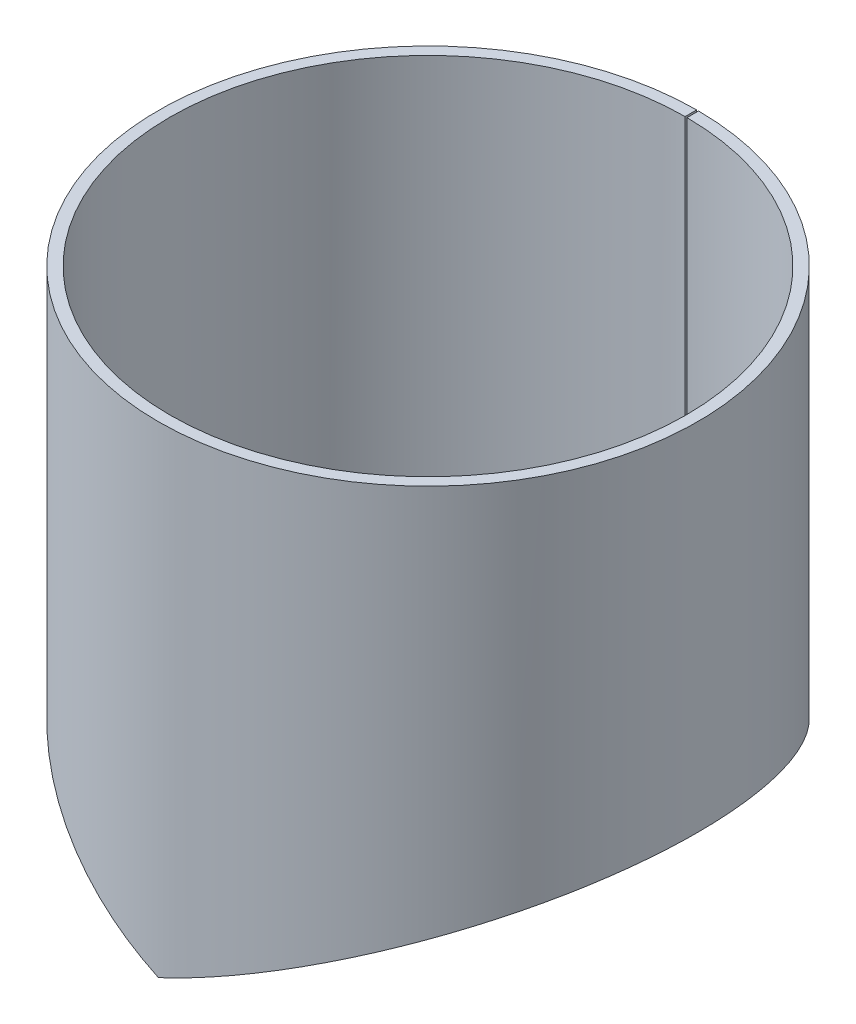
ISO-10303-21;
HEADER;
FILE_DESCRIPTION(('STEP AP214'),'2;1');
FILE_NAME('part.step','',(''),(''),'','','');
FILE_SCHEMA(('AUTOMOTIVE_DESIGN { 1 0 10303 214 1 1 1 1 }'));
ENDSEC;
DATA;
#1=APPLICATION_CONTEXT('core data for automotive mechanical design processes');
#2=APPLICATION_PROTOCOL_DEFINITION('international standard','automotive_design',2000,#1);
#3=PRODUCT_CONTEXT('',#1,'mechanical');
#4=PRODUCT('Part','Part','',(#3));
#5=PRODUCT_RELATED_PRODUCT_CATEGORY('part','',(#4));
#6=PRODUCT_DEFINITION_FORMATION('','',#4);
#7=PRODUCT_DEFINITION_CONTEXT('part definition',#1,'design');
#8=PRODUCT_DEFINITION('design','',#6,#7);
#9=PRODUCT_DEFINITION_SHAPE('','',#8);
#10=(LENGTH_UNIT() NAMED_UNIT(*) SI_UNIT(.MILLI.,.METRE.));
#11=(NAMED_UNIT(*) PLANE_ANGLE_UNIT() SI_UNIT($,.RADIAN.));
#12=(NAMED_UNIT(*) SI_UNIT($,.STERADIAN.) SOLID_ANGLE_UNIT());
#13=UNCERTAINTY_MEASURE_WITH_UNIT(LENGTH_MEASURE(1.E-05),#10,'distance_accuracy_value','');
#14=(GEOMETRIC_REPRESENTATION_CONTEXT(3) GLOBAL_UNCERTAINTY_ASSIGNED_CONTEXT((#13)) GLOBAL_UNIT_ASSIGNED_CONTEXT((#10,
#11,#12)) REPRESENTATION_CONTEXT('',''));
#15=CARTESIAN_POINT('',(0.,0.,0.));
#16=DIRECTION('',(0.,0.,1.));
#17=DIRECTION('',(1.,0.,0.));
#18=AXIS2_PLACEMENT_3D('',#15,#16,#17);
#19=CARTESIAN_POINT('',(0.,250.,0.));
#20=DIRECTION('',(0.,-1.,0.));
#21=DIRECTION('',(0.,0.,-1.));
#22=AXIS2_PLACEMENT_3D('',#19,#20,#21);
#23=PLANE('',#22);
#24=DIRECTION('',(0.00357142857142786,0.,-0.999993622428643));
#25=VECTOR('',#24,1.);
#26=CARTESIAN_POINT('',(0.478571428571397,250.,-133.999145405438));
#27=LINE('',#26,#25);
#28=CARTESIAN_POINT('',(0.478571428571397,250.,-133.999145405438));
#29=VERTEX_POINT('',#28);
#30=CARTESIAN_POINT('',(0.499999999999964,250.,-139.99910714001));
#31=VERTEX_POINT('',#30);
#32=EDGE_CURVE('E13',#29,#31,#27,.T.);
#33=ORIENTED_EDGE('',*,*,#32,.F.);
#34=CARTESIAN_POINT('',(0.,250.,0.));
#35=DIRECTION('',(0.,1.,0.));
#36=DIRECTION('',(0.,0.,1.));
#37=AXIS2_PLACEMENT_3D('',#34,#35,#36);
#38=CIRCLE('',#37,134.);
#39=CARTESIAN_POINT('',(-0.478571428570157,250.,-133.999145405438));
#40=VERTEX_POINT('',#39);
#41=EDGE_CURVE('E98',#40,#29,#38,.T.);
#42=ORIENTED_EDGE('',*,*,#41,.F.);
#43=DIRECTION('',(-0.00357142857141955,0.,-0.999993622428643));
#44=VECTOR('',#43,1.);
#45=CARTESIAN_POINT('',(-0.478571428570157,250.,-133.999145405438));
#46=LINE('',#45,#44);
#47=CARTESIAN_POINT('',(-0.499999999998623,250.,-139.99910714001));
#48=VERTEX_POINT('',#47);
#49=EDGE_CURVE('E50',#40,#48,#46,.T.);
#50=ORIENTED_EDGE('',*,*,#49,.T.);
#51=CARTESIAN_POINT('',(0.,250.,0.));
#52=DIRECTION('',(0.,1.,0.));
#53=DIRECTION('',(0.,0.,1.));
#54=AXIS2_PLACEMENT_3D('',#51,#52,#53);
#55=CIRCLE('',#54,140.);
#56=EDGE_CURVE('E97',#48,#31,#55,.T.);
#57=ORIENTED_EDGE('',*,*,#56,.T.);
#58=EDGE_LOOP('',(#33,#42,#50,#57));
#59=FACE_BOUND('',#58,.T.);
#60=ADVANCED_FACE('F38',(#59),#23,.F.);
#61=CARTESIAN_POINT('',(-0.478571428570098,125.116576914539,-133.999145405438));
#62=DIRECTION('',(-0.999993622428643,0.,0.00357142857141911));
#63=DIRECTION('',(0.,1.,0.));
#64=AXIS2_PLACEMENT_3D('',#61,#62,#63);
#65=PLANE('',#64);
#66=ORIENTED_EDGE('',*,*,#49,.F.);
#67=DIRECTION('',(0.,1.,0.));
#68=VECTOR('',#67,1.);
#69=CARTESIAN_POINT('',(-0.478571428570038,0.233153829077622,-133.999145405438));
#70=LINE('',#69,#68);
#71=CARTESIAN_POINT('',(-0.478571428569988,0.233153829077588,-133.999145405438));
#72=VERTEX_POINT('',#71);
#73=EDGE_CURVE('E130',#72,#40,#70,.T.);
#74=ORIENTED_EDGE('',*,*,#73,.F.);
#75=CARTESIAN_POINT('',(-0.499999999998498,0.233153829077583,-139.99910714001));
#76=CARTESIAN_POINT('',(-0.478571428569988,0.233153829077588,-133.999145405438));
#77=B_SPLINE_CURVE_WITH_KNOTS('',1,(#75,#76),.UNSPECIFIED.,.F.,.F.,(2,2),(0.,1.),.UNSPECIFIED.);
#78=CARTESIAN_POINT('',(-0.49999999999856,0.233153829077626,-139.99910714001));
#79=VERTEX_POINT('',#78);
#80=EDGE_CURVE('E90',#72,#79,#77,.F.);
#81=ORIENTED_EDGE('',*,*,#80,.T.);
#82=DIRECTION('',(0.,1.,0.));
#83=VECTOR('',#82,1.);
#84=CARTESIAN_POINT('',(-0.49999999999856,-877.190197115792,-139.999107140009));
#85=LINE('',#84,#83);
#86=EDGE_CURVE('E106',#79,#48,#85,.T.);
#87=ORIENTED_EDGE('',*,*,#86,.T.);
#88=EDGE_LOOP('',(#66,#74,#81,#87));
#89=FACE_BOUND('',#88,.T.);
#90=ADVANCED_FACE('F110',(#89),#65,.F.);
#91=CARTESIAN_POINT('',(-0.499999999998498,0.233153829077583,-139.99910714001));
#92=CARTESIAN_POINT('',(-4.36574562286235,2.03577303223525,-139.985300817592));
#93=CARTESIAN_POINT('',(-7.60783686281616,3.54703664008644,-139.817757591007));
#94=CARTESIAN_POINT('',(-10.8788741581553,5.07266025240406,-139.578223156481));
#95=CARTESIAN_POINT('',(-11.4940490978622,5.35959987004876,-139.528568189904));
#96=CARTESIAN_POINT('',(-12.6464714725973,5.89710889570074,-139.428839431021));
#97=CARTESIAN_POINT('',(-13.1779037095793,6.14495809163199,-139.379340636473));
#98=CARTESIAN_POINT('',(-14.6936620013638,6.85176394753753,-139.230482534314));
#99=CARTESIAN_POINT('',(-15.6821465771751,7.31266711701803,-139.122311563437));
#100=CARTESIAN_POINT('',(-18.5813013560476,8.66447442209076,-138.775085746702));
#101=CARTESIAN_POINT('',(-20.4256314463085,9.5244763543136,-138.513377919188));
#102=CARTESIAN_POINT('',(-23.059359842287,10.7526748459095,-138.090754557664));
#103=CARTESIAN_POINT('',(-23.9151523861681,11.1517736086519,-137.944854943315));
#104=CARTESIAN_POINT('',(-25.5826010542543,11.9293696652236,-137.645370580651));
#105=CARTESIAN_POINT('',(-26.3902828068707,12.3060025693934,-137.492592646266));
#106=CARTESIAN_POINT('',(-30.3751521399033,14.1641108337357,-136.703734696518));
#107=CARTESIAN_POINT('',(-33.403088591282,15.5759855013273,-135.989148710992));
#108=CARTESIAN_POINT('',(-37.7045156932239,17.5818795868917,-134.835355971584));
#109=CARTESIAN_POINT('',(-39.0933667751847,18.2295403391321,-134.438595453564));
#110=CARTESIAN_POINT('',(-41.8195239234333,19.5007412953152,-133.615697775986));
#111=CARTESIAN_POINT('',(-43.1576506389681,20.124691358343,-133.189094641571));
#112=CARTESIAN_POINT('',(-47.0969594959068,21.9615903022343,-131.869433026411));
#113=CARTESIAN_POINT('',(-49.6198217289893,23.1381240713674,-130.937862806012));
#114=CARTESIAN_POINT('',(-54.4793340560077,25.4040981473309,-128.991677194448));
#115=CARTESIAN_POINT('',(-56.8416818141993,26.5054101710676,-127.966517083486));
#116=CARTESIAN_POINT('',(-63.7242273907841,29.7143211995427,-124.759159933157));
#117=CARTESIAN_POINT('',(-68.0393458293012,31.7268951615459,-122.44548428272));
#118=CARTESIAN_POINT('',(-74.1047908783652,34.5557060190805,-118.802534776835));
#119=CARTESIAN_POINT('',(-76.0542071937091,35.4646326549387,-117.562762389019));
#120=CARTESIAN_POINT('',(-79.8589872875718,37.2385130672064,-115.012119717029));
#121=CARTESIAN_POINT('',(-81.7107958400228,38.1018598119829,-113.703039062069));
#122=CARTESIAN_POINT('',(-87.1137691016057,40.6211196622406,-109.687429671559));
#123=CARTESIAN_POINT('',(-90.5122186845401,42.2062523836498,-106.892696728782));
#124=CARTESIAN_POINT('',(-95.3068781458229,44.4423906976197,-102.573030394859));
#125=CARTESIAN_POINT('',(-96.8524521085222,45.1630548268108,-101.114113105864));
#126=CARTESIAN_POINT('',(-99.8587091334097,46.5646665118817,-98.1463170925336));
#127=CARTESIAN_POINT('',(-101.318646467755,47.2453131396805,-96.6378809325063));
#128=CARTESIAN_POINT('',(-105.568376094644,49.2267753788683,-92.0473279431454));
#129=CARTESIAN_POINT('',(-108.227936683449,50.4671133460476,-88.9000462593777));
#130=CARTESIAN_POINT('',(-113.200949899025,52.7865155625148,-82.4745381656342));
#131=CARTESIAN_POINT('',(-115.511276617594,53.8637538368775,-79.201924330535));
#132=CARTESIAN_POINT('',(-119.819000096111,55.8721134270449,-72.5203906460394));
#133=CARTESIAN_POINT('',(-121.81325069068,56.8019770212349,-69.1146233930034));
#134=CARTESIAN_POINT('',(-127.316624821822,59.368619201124,-58.7509479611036));
#135=CARTESIAN_POINT('',(-130.343478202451,60.7798517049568,-51.6607389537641));
#136=CARTESIAN_POINT('',(-133.976199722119,62.4736881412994,-40.8036943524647));
#137=CARTESIAN_POINT('',(-135.033721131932,62.9669704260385,-37.1510848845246));
#138=CARTESIAN_POINT('',(-136.842838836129,63.8108752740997,-29.8051406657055));
#139=CARTESIAN_POINT('',(-137.594356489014,64.1612737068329,-26.1140832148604));
#140=CARTESIAN_POINT('',(-139.400141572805,65.0029498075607,-14.9736317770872));
#141=CARTESIAN_POINT('',(-140.000678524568,65.2833627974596,-7.47006062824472));
#142=CARTESIAN_POINT('',(-139.999320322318,65.2827799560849,7.4954721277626));
#143=CARTESIAN_POINT('',(-139.397578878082,65.001733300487,14.9978985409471));
#144=CARTESIAN_POINT('',(-137.589582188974,64.1590248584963,26.1392877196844));
#145=CARTESIAN_POINT('',(-136.837302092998,63.8083112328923,29.8305305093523));
#146=CARTESIAN_POINT('',(-135.026902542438,62.9638206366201,37.1758440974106));
#147=CARTESIAN_POINT('',(-133.968688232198,62.4701954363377,40.8283882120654));
#148=CARTESIAN_POINT('',(-130.3335413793,60.7751801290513,51.6859249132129));
#149=CARTESIAN_POINT('',(-127.304962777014,59.3632266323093,58.7763117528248));
#150=CARTESIAN_POINT('',(-121.79895250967,56.7953163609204,69.1398384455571));
#151=CARTESIAN_POINT('',(-119.803628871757,55.8649259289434,72.5458425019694));
#152=CARTESIAN_POINT('',(-115.493218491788,53.8553043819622,79.2283108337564));
#153=CARTESIAN_POINT('',(-113.181894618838,52.777656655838,82.5006965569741));
#154=CARTESIAN_POINT('',(-108.20713131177,50.4574456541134,88.9253784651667));
#155=CARTESIAN_POINT('',(-105.546347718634,49.21650568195,92.0726469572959));
#156=CARTESIAN_POINT('',(-101.294103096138,47.2338440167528,96.6636210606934));
#157=CARTESIAN_POINT('',(-99.8332142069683,46.5527481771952,98.1722706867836));
#158=CARTESIAN_POINT('',(-96.8248039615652,45.1501392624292,101.140608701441));
#159=CARTESIAN_POINT('',(-95.2788333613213,44.4293246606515,102.599078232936));
#160=CARTESIAN_POINT('',(-90.4833322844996,42.1928382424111,106.91713773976));
#161=CARTESIAN_POINT('',(-87.0836953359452,40.6071201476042,109.711368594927));
#162=CARTESIAN_POINT('',(-81.6777805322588,38.0864522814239,113.726772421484));
#163=CARTESIAN_POINT('',(-79.8247984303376,37.2225478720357,115.03587509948));
#164=CARTESIAN_POINT('',(-76.0172539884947,35.4473754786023,117.586683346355));
#165=CARTESIAN_POINT('',(-74.0675271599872,34.5383372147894,118.825755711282));
#166=CARTESIAN_POINT('',(-68.0028686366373,31.7099273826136,122.465689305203));
#167=CARTESIAN_POINT('',(-63.6864724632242,29.6966918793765,124.77855747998));
#168=CARTESIAN_POINT('',(-56.7988542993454,26.4853952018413,127.985561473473));
#169=CARTESIAN_POINT('',(-54.4342909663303,25.3830557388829,129.010744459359));
#170=CARTESIAN_POINT('',(-49.5692431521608,23.1145623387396,130.957070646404));
#171=CARTESIAN_POINT('',(-47.0491498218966,21.9392995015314,131.886527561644));
#172=CARTESIAN_POINT('',(-43.1073751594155,20.1012406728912,133.205382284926));
#173=CARTESIAN_POINT('',(-41.7680662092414,19.4767374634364,133.631807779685));
#174=CARTESIAN_POINT('',(-39.0388066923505,18.2040971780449,134.454464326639));
#175=CARTESIAN_POINT('',(-37.650988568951,17.5569310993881,134.850308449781));
#176=CARTESIAN_POINT('',(-33.3501751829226,15.5513195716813,136.002118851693));
#177=CARTESIAN_POINT('',(-30.3190796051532,14.1379434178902,136.716341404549));
#178=CARTESIAN_POINT('',(-26.3256223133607,12.2758459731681,137.504997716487));
#179=CARTESIAN_POINT('',(-25.5196620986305,11.9000284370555,137.657044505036));
#180=CARTESIAN_POINT('',(-23.8549449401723,11.1237141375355,137.955270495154));
#181=CARTESIAN_POINT('',(-22.9995918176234,10.724818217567,138.100724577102));
#182=CARTESIAN_POINT('',(-20.3643773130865,9.49591414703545,138.522408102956));
#183=CARTESIAN_POINT('',(-18.5153154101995,8.63368968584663,138.784023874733));
#184=CARTESIAN_POINT('',(-15.6033757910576,7.27592037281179,139.131197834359));
#185=CARTESIAN_POINT('',(-14.6096821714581,6.81259183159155,139.239364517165));
#186=CARTESIAN_POINT('',(-13.3388509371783,6.22000769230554,139.363339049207));
#187=CARTESIAN_POINT('',(-13.0864386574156,6.10231071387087,139.387282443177));
#188=CARTESIAN_POINT('',(-12.5618380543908,5.85766956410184,139.435539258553));
#189=CARTESIAN_POINT('',(-12.288086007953,5.72999523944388,139.459975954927));
#190=CARTESIAN_POINT('',(-11.4324351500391,5.33091101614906,139.533606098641));
#191=CARTESIAN_POINT('',(-10.8161398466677,5.04343986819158,139.583136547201));
#192=CARTESIAN_POINT('',(-7.50490769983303,3.49900913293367,139.823927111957));
#193=CARTESIAN_POINT('',(-4.11976621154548,1.92107434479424,140.));
#194=CARTESIAN_POINT('',(0.,0.,140.));
#195=CARTESIAN_POINT('',(-0.478571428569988,0.233153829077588,-133.999145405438));
#196=CARTESIAN_POINT('',(-4.1786357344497,2.03576986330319,-133.985930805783));
#197=CARTESIAN_POINT('',(-7.28178671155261,3.54703664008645,-133.825567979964));
#198=CARTESIAN_POINT('',(-10.4126366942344,5.07266025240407,-133.596299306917));
#199=CARTESIAN_POINT('',(-11.0014469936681,5.35959987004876,-133.548772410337));
#200=CARTESIAN_POINT('',(-12.1044798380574,5.89710889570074,-133.45331774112));
#201=CARTESIAN_POINT('',(-12.6131364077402,6.144958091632,-133.405940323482));
#202=CARTESIAN_POINT('',(-14.0639336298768,6.85176394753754,-133.263461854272));
#203=CARTESIAN_POINT('',(-15.0100545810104,7.31266711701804,-133.159926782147));
#204=CARTESIAN_POINT('',(-17.7849598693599,8.66447442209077,-132.827582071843));
#205=CARTESIAN_POINT('',(-19.5502472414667,9.52447635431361,-132.57709029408));
#206=CARTESIAN_POINT('',(-22.0711015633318,10.7526748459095,-132.172579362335));
#207=CARTESIAN_POINT('',(-22.8902172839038,11.1517736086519,-132.032932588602));
#208=CARTESIAN_POINT('',(-24.4862038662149,11.9293696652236,-131.746283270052));
#209=CARTESIAN_POINT('',(-25.2592706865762,12.3060025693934,-131.600052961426));
#210=CARTESIAN_POINT('',(-29.073359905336,14.1641108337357,-130.845003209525));
#211=CARTESIAN_POINT('',(-31.9715276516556,15.5759855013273,-130.161042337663));
#212=CARTESIAN_POINT('',(-36.0886078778,17.5818795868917,-129.056697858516));
#213=CARTESIAN_POINT('',(-37.4179367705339,18.2295403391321,-128.676941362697));
#214=CARTESIAN_POINT('',(-40.027258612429,19.5007412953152,-127.889310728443));
#215=CARTESIAN_POINT('',(-41.3080370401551,20.124691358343,-127.480990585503));
#216=CARTESIAN_POINT('',(-45.0785183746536,21.9615903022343,-126.217885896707));
#217=CARTESIAN_POINT('',(-47.493257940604,23.1381240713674,-125.326240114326));
#218=CARTESIAN_POINT('',(-52.1445054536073,25.4040981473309,-123.463462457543));
#219=CARTESIAN_POINT('',(-54.4056097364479,26.5054101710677,-122.482237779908));
#220=CARTESIAN_POINT('',(-60.9931890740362,29.7143211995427,-119.412338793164));
#221=CARTESIAN_POINT('',(-65.1233738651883,31.7268951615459,-117.197820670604));
#222=CARTESIAN_POINT('',(-70.9288712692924,34.5557060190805,-113.710997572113));
#223=CARTESIAN_POINT('',(-72.7947411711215,35.4646326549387,-112.524358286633));
#224=CARTESIAN_POINT('',(-76.4364592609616,37.2385130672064,-110.083028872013));
#225=CARTESIAN_POINT('',(-78.2089045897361,38.1018598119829,-108.830051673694));
#226=CARTESIAN_POINT('',(-83.380321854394,40.6211196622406,-104.986539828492));
#227=CARTESIAN_POINT('',(-86.6331235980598,42.2062523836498,-102.311581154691));
#228=CARTESIAN_POINT('',(-91.222297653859,44.4423906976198,-98.177043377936));
#229=CARTESIAN_POINT('',(-92.7016327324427,45.1630548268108,-96.7806511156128));
#230=CARTESIAN_POINT('',(-95.5790501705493,46.5646665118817,-93.9400463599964));
#231=CARTESIAN_POINT('',(-96.9764187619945,47.2453131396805,-92.4962574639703));
#232=CARTESIAN_POINT('',(-101.044017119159,49.2267753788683,-88.1024424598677));
#233=CARTESIAN_POINT('',(-103.589596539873,50.4671133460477,-85.0900442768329));
#234=CARTESIAN_POINT('',(-108.349480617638,52.7865155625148,-78.9399151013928));
#235=CARTESIAN_POINT('',(-110.560793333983,53.8637538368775,-75.8075561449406));
#236=CARTESIAN_POINT('',(-114.683900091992,55.8721134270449,-69.4123739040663));
#237=CARTESIAN_POINT('',(-116.592682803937,56.8019770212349,-66.1525681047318));
#238=CARTESIAN_POINT('',(-121.860198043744,59.368619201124,-56.233050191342));
#239=CARTESIAN_POINT('',(-124.757329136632,60.7798517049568,-49.4467072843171));
#240=CARTESIAN_POINT('',(-128.234362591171,62.4736881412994,-39.0549645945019));
#241=CARTESIAN_POINT('',(-129.246561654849,62.9669704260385,-35.5588955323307));
#242=CARTESIAN_POINT('',(-130.978145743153,63.8108752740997,-28.5277774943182));
#243=CARTESIAN_POINT('',(-131.697455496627,64.1612737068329,-24.9949082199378));
#244=CARTESIAN_POINT('',(-133.425849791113,65.0029498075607,-14.3319047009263));
#245=CARTESIAN_POINT('',(-134.000649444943,65.2833627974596,-7.14991517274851));
#246=CARTESIAN_POINT('',(-133.999349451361,65.2827799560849,7.17423760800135));
#247=CARTESIAN_POINT('',(-133.423396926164,65.001733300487,14.3551314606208));
#248=CARTESIAN_POINT('',(-131.692885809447,64.1590248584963,25.0190325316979));
#249=CARTESIAN_POINT('',(-130.972846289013,63.8083112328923,28.5520792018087));
#250=CARTESIAN_POINT('',(-129.240035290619,62.9638206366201,35.582593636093));
#251=CARTESIAN_POINT('',(-128.227173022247,62.4701954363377,39.0786001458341));
#252=CARTESIAN_POINT('',(-124.74781817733,60.7751801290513,49.4708138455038));
#253=CARTESIAN_POINT('',(-121.849035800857,59.3632266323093,56.2573269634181));
#254=CARTESIAN_POINT('',(-116.578997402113,56.7953163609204,66.1767025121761));
#255=CARTESIAN_POINT('',(-114.669187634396,55.8649259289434,69.4367349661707));
#256=CARTESIAN_POINT('',(-110.543509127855,53.8553043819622,75.832811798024));
#257=CARTESIAN_POINT('',(-108.331241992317,52.777656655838,78.9649524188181));
#258=CARTESIAN_POINT('',(-103.56968282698,50.4574456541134,85.1142908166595));
#259=CARTESIAN_POINT('',(-101.022932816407,49.2165056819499,88.1266763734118));
#260=CARTESIAN_POINT('',(-96.952927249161,47.2338440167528,92.5208944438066));
#261=CARTESIAN_POINT('',(-95.5546478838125,46.5527481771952,93.96488765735));
#262=CARTESIAN_POINT('',(-92.6751695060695,45.1501392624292,96.806011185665));
#263=CARTESIAN_POINT('',(-91.1954547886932,44.4293246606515,98.2019748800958));
#264=CARTESIAN_POINT('',(-86.6054751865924,42.1928382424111,102.33497469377));
#265=CARTESIAN_POINT('',(-83.3515369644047,40.6071201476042,105.009452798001));
#266=CARTESIAN_POINT('',(-78.1773042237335,38.0864522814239,108.852767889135));
#267=CARTESIAN_POINT('',(-76.4037356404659,37.2225478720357,110.105766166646));
#268=CARTESIAN_POINT('',(-72.759371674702,35.4473754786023,112.547254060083));
#269=CARTESIAN_POINT('',(-70.8932045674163,34.5383372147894,113.733223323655));
#270=CARTESIAN_POINT('',(-65.0884599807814,31.7099273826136,117.217159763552));
#271=CARTESIAN_POINT('',(-60.9570522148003,29.6966918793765,119.430905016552));
#272=CARTESIAN_POINT('',(-54.3646176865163,26.4853952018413,122.500465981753));
#273=CARTESIAN_POINT('',(-52.101392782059,25.3830557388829,123.481712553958));
#274=CARTESIAN_POINT('',(-47.4448470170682,23.1145623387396,125.344624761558));
#275=CARTESIAN_POINT('',(-45.0327576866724,21.9392995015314,126.234247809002));
#276=CARTESIAN_POINT('',(-41.259916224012,20.1012406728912,127.496580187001));
#277=CARTESIAN_POINT('',(-39.9780062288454,19.4767374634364,127.904730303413));
#278=CARTESIAN_POINT('',(-37.3657149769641,18.2040971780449,128.692130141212));
#279=CARTESIAN_POINT('',(-36.0373747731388,17.5569310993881,129.071009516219));
#280=CARTESIAN_POINT('',(-31.9208819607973,15.5513195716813,130.173456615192));
#281=CARTESIAN_POINT('',(-29.019690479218,14.1379434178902,130.857069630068));
#282=CARTESIAN_POINT('',(-25.1973813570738,12.2758459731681,131.611926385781));
#283=CARTESIAN_POINT('',(-24.4259622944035,11.9000284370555,131.757456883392));
#284=CARTESIAN_POINT('',(-22.8325901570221,11.1237141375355,132.042901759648));
#285=CARTESIAN_POINT('',(-22.0138950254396,10.724818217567,132.182122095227));
#286=CARTESIAN_POINT('',(-19.4916182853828,9.49591414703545,132.585733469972));
#287=CARTESIAN_POINT('',(-17.7218018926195,8.63368968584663,132.836137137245));
#288=CARTESIAN_POINT('',(-14.9346596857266,7.27592037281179,133.168432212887));
#289=CARTESIAN_POINT('',(-13.9835529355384,6.81259183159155,133.271963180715));
#290=CARTESIAN_POINT('',(-12.7671858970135,6.22000769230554,133.390624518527));
#291=CARTESIAN_POINT('',(-12.5255912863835,6.10231071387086,133.413541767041));
#292=CARTESIAN_POINT('',(-12.0234735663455,5.85766956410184,133.459730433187));
#293=CARTESIAN_POINT('',(-11.7614537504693,5.72999523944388,133.483119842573));
#294=CARTESIAN_POINT('',(-10.9424736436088,5.33091101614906,133.5535944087));
#295=CARTESIAN_POINT('',(-10.3525909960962,5.04343986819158,133.601002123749));
#296=CARTESIAN_POINT('',(-7.18326879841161,3.49900913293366,133.831473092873));
#297=CARTESIAN_POINT('',(-3.94319655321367,1.92107032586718,134.));
#298=CARTESIAN_POINT('',(0.,0.,134.));
#299=B_SPLINE_SURFACE_WITH_KNOTS('',1,3,((#91,#92,#93,#94,#95,#96,#97,#98,#99,#100,#101,#102,
#103,#104,#105,#106,#107,#108,#109,#110,#111,#112,#113,#114,#115,#116,#117,#118,#119,#120,#121,
#122,#123,#124,#125,#126,#127,#128,#129,#130,#131,#132,#133,#134,#135,#136,#137,#138,#139,#140,
#141,#142,#143,#144,#145,#146,#147,#148,#149,#150,#151,#152,#153,#154,#155,#156,#157,#158,#159,
#160,#161,#162,#163,#164,#165,#166,#167,#168,#169,#170,#171,#172,#173,#174,#175,#176,#177,#178,
#179,#180,#181,#182,#183,#184,#185,#186,#187,#188,#189,#190,#191,#192,#193,#194),(#195,#196,
#197,#198,#199,#200,#201,#202,#203,#204,#205,#206,#207,#208,#209,#210,#211,#212,#213,#214,#215,
#216,#217,#218,#219,#220,#221,#222,#223,#224,#225,#226,#227,#228,#229,#230,#231,#232,#233,#234,
#235,#236,#237,#238,#239,#240,#241,#242,#243,#244,#245,#246,#247,#248,#249,#250,#251,#252,#253,
#254,#255,#256,#257,#258,#259,#260,#261,#262,#263,#264,#265,#266,#267,#268,#269,#270,#271,#272,
#273,#274,#275,#276,#277,#278,#279,#280,#281,#282,#283,#284,#285,#286,#287,#288,#289,#290,#291,
#292,#293,#294,#295,#296,#297,#298)),.UNSPECIFIED.,.F.,.F.,.F.,(2,2),(4,2,2,2,2,2,2,2,2,2,2,2,2,
2,2,2,2,2,2,2,2,2,2,2,2,2,2,2,2,2,2,2,2,2,2,2,2,2,2,2,2,2,2,2,2,2,2,2,2,2,2,4),(0.,1.),(0.,
0.0078125,0.009765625,0.01171875,0.015625,0.0234375,0.02734375,0.03125,0.046875,0.0546875,
0.0625,0.078125,0.09375,0.125,0.140625,0.15625,0.1875,0.203125,0.21875,0.25,0.28125,0.3125,
0.375,0.40625,0.4375,0.5,0.5625,0.59375,0.625,0.6875,0.71875,0.75,0.78125,0.796875,0.8125,
0.84375,0.859375,0.875,0.90625,0.921875,0.9375,0.9453125,0.953125,0.96875,0.97265625,0.9765625,
0.984375,0.98828125,0.9892578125,0.990234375,0.9921875,1.),.UNSPECIFIED.);
#300=CARTESIAN_POINT('',(-0.478571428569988,0.233153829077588,-133.999145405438));
#301=CARTESIAN_POINT('',(-4.1786357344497,2.03576986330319,-133.985930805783));
#302=CARTESIAN_POINT('',(-7.28178671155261,3.54703664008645,-133.825567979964));
#303=CARTESIAN_POINT('',(-10.4126366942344,5.07266025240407,-133.596299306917));
#304=CARTESIAN_POINT('',(-11.0014469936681,5.35959987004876,-133.548772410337));
#305=CARTESIAN_POINT('',(-12.1044798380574,5.89710889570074,-133.45331774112));
#306=CARTESIAN_POINT('',(-12.6131364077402,6.144958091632,-133.405940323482));
#307=CARTESIAN_POINT('',(-14.0639336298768,6.85176394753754,-133.263461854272));
#308=CARTESIAN_POINT('',(-15.0100545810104,7.31266711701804,-133.159926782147));
#309=CARTESIAN_POINT('',(-17.7849598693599,8.66447442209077,-132.827582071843));
#310=CARTESIAN_POINT('',(-19.5502472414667,9.52447635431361,-132.57709029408));
#311=CARTESIAN_POINT('',(-22.0711015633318,10.7526748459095,-132.172579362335));
#312=CARTESIAN_POINT('',(-22.8902172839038,11.1517736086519,-132.032932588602));
#313=CARTESIAN_POINT('',(-24.4862038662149,11.9293696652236,-131.746283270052));
#314=CARTESIAN_POINT('',(-25.2592706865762,12.3060025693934,-131.600052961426));
#315=CARTESIAN_POINT('',(-29.073359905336,14.1641108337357,-130.845003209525));
#316=CARTESIAN_POINT('',(-31.9715276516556,15.5759855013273,-130.161042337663));
#317=CARTESIAN_POINT('',(-36.0886078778,17.5818795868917,-129.056697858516));
#318=CARTESIAN_POINT('',(-37.4179367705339,18.2295403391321,-128.676941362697));
#319=CARTESIAN_POINT('',(-40.027258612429,19.5007412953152,-127.889310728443));
#320=CARTESIAN_POINT('',(-41.3080370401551,20.124691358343,-127.480990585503));
#321=CARTESIAN_POINT('',(-45.0785183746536,21.9615903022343,-126.217885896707));
#322=CARTESIAN_POINT('',(-47.493257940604,23.1381240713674,-125.326240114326));
#323=CARTESIAN_POINT('',(-52.1445054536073,25.4040981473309,-123.463462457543));
#324=CARTESIAN_POINT('',(-54.4056097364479,26.5054101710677,-122.482237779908));
#325=CARTESIAN_POINT('',(-60.9931890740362,29.7143211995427,-119.412338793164));
#326=CARTESIAN_POINT('',(-65.1233738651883,31.7268951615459,-117.197820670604));
#327=CARTESIAN_POINT('',(-70.9288712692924,34.5557060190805,-113.710997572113));
#328=CARTESIAN_POINT('',(-72.7947411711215,35.4646326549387,-112.524358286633));
#329=CARTESIAN_POINT('',(-76.4364592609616,37.2385130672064,-110.083028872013));
#330=CARTESIAN_POINT('',(-78.2089045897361,38.1018598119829,-108.830051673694));
#331=CARTESIAN_POINT('',(-83.380321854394,40.6211196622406,-104.986539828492));
#332=CARTESIAN_POINT('',(-86.6331235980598,42.2062523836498,-102.311581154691));
#333=CARTESIAN_POINT('',(-91.222297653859,44.4423906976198,-98.177043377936));
#334=CARTESIAN_POINT('',(-92.7016327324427,45.1630548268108,-96.7806511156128));
#335=CARTESIAN_POINT('',(-95.5790501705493,46.5646665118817,-93.9400463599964));
#336=CARTESIAN_POINT('',(-96.9764187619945,47.2453131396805,-92.4962574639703));
#337=CARTESIAN_POINT('',(-101.044017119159,49.2267753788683,-88.1024424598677));
#338=CARTESIAN_POINT('',(-103.589596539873,50.4671133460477,-85.0900442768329));
#339=CARTESIAN_POINT('',(-108.349480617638,52.7865155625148,-78.9399151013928));
#340=CARTESIAN_POINT('',(-110.560793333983,53.8637538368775,-75.8075561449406));
#341=CARTESIAN_POINT('',(-114.683900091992,55.8721134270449,-69.4123739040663));
#342=CARTESIAN_POINT('',(-116.592682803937,56.8019770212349,-66.1525681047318));
#343=CARTESIAN_POINT('',(-121.860198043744,59.368619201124,-56.233050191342));
#344=CARTESIAN_POINT('',(-124.757329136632,60.7798517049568,-49.4467072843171));
#345=CARTESIAN_POINT('',(-128.234362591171,62.4736881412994,-39.0549645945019));
#346=CARTESIAN_POINT('',(-129.246561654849,62.9669704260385,-35.5588955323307));
#347=CARTESIAN_POINT('',(-130.978145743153,63.8108752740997,-28.5277774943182));
#348=CARTESIAN_POINT('',(-131.697455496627,64.1612737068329,-24.9949082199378));
#349=CARTESIAN_POINT('',(-133.425849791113,65.0029498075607,-14.3319047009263));
#350=CARTESIAN_POINT('',(-134.000649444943,65.2833627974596,-7.14991517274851));
#351=CARTESIAN_POINT('',(-133.999349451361,65.2827799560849,7.17423760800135));
#352=CARTESIAN_POINT('',(-133.423396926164,65.001733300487,14.3551314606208));
#353=CARTESIAN_POINT('',(-131.692885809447,64.1590248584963,25.0190325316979));
#354=CARTESIAN_POINT('',(-130.972846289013,63.8083112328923,28.5520792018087));
#355=CARTESIAN_POINT('',(-129.240035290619,62.9638206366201,35.582593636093));
#356=CARTESIAN_POINT('',(-128.227173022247,62.4701954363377,39.0786001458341));
#357=CARTESIAN_POINT('',(-124.74781817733,60.7751801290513,49.4708138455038));
#358=CARTESIAN_POINT('',(-121.849035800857,59.3632266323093,56.2573269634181));
#359=CARTESIAN_POINT('',(-116.578997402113,56.7953163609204,66.1767025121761));
#360=CARTESIAN_POINT('',(-114.669187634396,55.8649259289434,69.4367349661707));
#361=CARTESIAN_POINT('',(-110.543509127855,53.8553043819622,75.832811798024));
#362=CARTESIAN_POINT('',(-108.331241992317,52.777656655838,78.9649524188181));
#363=CARTESIAN_POINT('',(-103.56968282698,50.4574456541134,85.1142908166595));
#364=CARTESIAN_POINT('',(-101.022932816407,49.2165056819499,88.1266763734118));
#365=CARTESIAN_POINT('',(-96.952927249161,47.2338440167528,92.5208944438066));
#366=CARTESIAN_POINT('',(-95.5546478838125,46.5527481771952,93.96488765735));
#367=CARTESIAN_POINT('',(-92.6751695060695,45.1501392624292,96.806011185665));
#368=CARTESIAN_POINT('',(-91.1954547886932,44.4293246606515,98.2019748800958));
#369=CARTESIAN_POINT('',(-86.6054751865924,42.1928382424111,102.33497469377));
#370=CARTESIAN_POINT('',(-83.3515369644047,40.6071201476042,105.009452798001));
#371=CARTESIAN_POINT('',(-78.1773042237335,38.0864522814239,108.852767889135));
#372=CARTESIAN_POINT('',(-76.4037356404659,37.2225478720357,110.105766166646));
#373=CARTESIAN_POINT('',(-72.759371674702,35.4473754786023,112.547254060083));
#374=CARTESIAN_POINT('',(-70.8932045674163,34.5383372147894,113.733223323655));
#375=CARTESIAN_POINT('',(-65.0884599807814,31.7099273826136,117.217159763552));
#376=CARTESIAN_POINT('',(-60.9570522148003,29.6966918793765,119.430905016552));
#377=CARTESIAN_POINT('',(-54.3646176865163,26.4853952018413,122.500465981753));
#378=CARTESIAN_POINT('',(-52.101392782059,25.3830557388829,123.481712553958));
#379=CARTESIAN_POINT('',(-47.4448470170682,23.1145623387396,125.344624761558));
#380=CARTESIAN_POINT('',(-45.0327576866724,21.9392995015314,126.234247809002));
#381=CARTESIAN_POINT('',(-41.259916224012,20.1012406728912,127.496580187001));
#382=CARTESIAN_POINT('',(-39.9780062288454,19.4767374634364,127.904730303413));
#383=CARTESIAN_POINT('',(-37.3657149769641,18.2040971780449,128.692130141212));
#384=CARTESIAN_POINT('',(-36.0373747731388,17.5569310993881,129.071009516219));
#385=CARTESIAN_POINT('',(-31.9208819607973,15.5513195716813,130.173456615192));
#386=CARTESIAN_POINT('',(-29.019690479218,14.1379434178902,130.857069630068));
#387=CARTESIAN_POINT('',(-25.1973813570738,12.2758459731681,131.611926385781));
#388=CARTESIAN_POINT('',(-24.4259622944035,11.9000284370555,131.757456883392));
#389=CARTESIAN_POINT('',(-22.8325901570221,11.1237141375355,132.042901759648));
#390=CARTESIAN_POINT('',(-22.0138950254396,10.724818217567,132.182122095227));
#391=CARTESIAN_POINT('',(-19.4916182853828,9.49591414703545,132.585733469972));
#392=CARTESIAN_POINT('',(-17.7218018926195,8.63368968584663,132.836137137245));
#393=CARTESIAN_POINT('',(-14.9346596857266,7.27592037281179,133.168432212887));
#394=CARTESIAN_POINT('',(-13.9835529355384,6.81259183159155,133.271963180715));
#395=CARTESIAN_POINT('',(-12.7671858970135,6.22000769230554,133.390624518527));
#396=CARTESIAN_POINT('',(-12.5255912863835,6.10231071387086,133.413541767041));
#397=CARTESIAN_POINT('',(-12.0234735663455,5.85766956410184,133.459730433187));
#398=CARTESIAN_POINT('',(-11.7614537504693,5.72999523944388,133.483119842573));
#399=CARTESIAN_POINT('',(-10.9424736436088,5.33091101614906,133.5535944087));
#400=CARTESIAN_POINT('',(-10.3525909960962,5.04343986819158,133.601002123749));
#401=CARTESIAN_POINT('',(-7.18326879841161,3.49900913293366,133.831473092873));
#402=CARTESIAN_POINT('',(-3.94319655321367,1.92107032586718,134.));
#403=CARTESIAN_POINT('',(0.,0.,134.));
#404=B_SPLINE_CURVE_WITH_KNOTS('',3,(#300,#301,#302,#303,#304,#305,#306,#307,#308,#309,#310,
#311,#312,#313,#314,#315,#316,#317,#318,#319,#320,#321,#322,#323,#324,#325,#326,#327,#328,#329,
#330,#331,#332,#333,#334,#335,#336,#337,#338,#339,#340,#341,#342,#343,#344,#345,#346,#347,#348,
#349,#350,#351,#352,#353,#354,#355,#356,#357,#358,#359,#360,#361,#362,#363,#364,#365,#366,#367,
#368,#369,#370,#371,#372,#373,#374,#375,#376,#377,#378,#379,#380,#381,#382,#383,#384,#385,#386,
#387,#388,#389,#390,#391,#392,#393,#394,#395,#396,#397,#398,#399,#400,#401,#402,#403),
.UNSPECIFIED.,.F.,.F.,(4,2,2,2,2,2,2,2,2,2,2,2,2,2,2,2,2,2,2,2,2,2,2,2,2,2,2,2,2,2,2,2,2,2,2,2,
2,2,2,2,2,2,2,2,2,2,2,2,2,2,2,4),(0.,0.0078125,0.009765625,0.01171875,0.015625,0.0234375,
0.02734375,0.03125,0.046875,0.0546875,0.0625,0.078125,0.09375,0.125,0.140625,0.15625,0.1875,
0.203125,0.21875,0.25,0.28125,0.3125,0.375,0.40625,0.4375,0.5,0.5625,0.59375,0.625,0.6875,
0.71875,0.75,0.78125,0.796875,0.8125,0.84375,0.859375,0.875,0.90625,0.921875,0.9375,0.9453125,
0.953125,0.96875,0.97265625,0.9765625,0.984375,0.98828125,0.9892578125,0.990234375,0.9921875,
1.),.UNSPECIFIED.);
#405=CARTESIAN_POINT('',(0.,0.,134.));
#406=VERTEX_POINT('',#405);
#407=EDGE_CURVE('E125',#72,#406,#404,.T.);
#408=CARTESIAN_POINT('',(0.,0.,134.));
#409=CARTESIAN_POINT('',(0.,0.,140.));
#410=B_SPLINE_CURVE_WITH_KNOTS('',1,(#408,#409),.UNSPECIFIED.,.F.,.F.,(2,2),(0.,1.),.UNSPECIFIED.);
#411=CARTESIAN_POINT('',(-5.37269258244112E-07,2.50532195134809E-07,140.));
#412=VERTEX_POINT('',#411);
#413=EDGE_CURVE('E186',#406,#412,#410,.T.);
#414=CARTESIAN_POINT('',(0.,0.,140.));
#415=CARTESIAN_POINT('',(-4.11976621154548,1.92107434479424,140.));
#416=CARTESIAN_POINT('',(-7.50490769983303,3.49900913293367,139.823927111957));
#417=CARTESIAN_POINT('',(-10.8161398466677,5.04343986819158,139.583136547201));
#418=CARTESIAN_POINT('',(-11.4324351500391,5.33091101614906,139.533606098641));
#419=CARTESIAN_POINT('',(-12.288086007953,5.72999523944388,139.459975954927));
#420=CARTESIAN_POINT('',(-12.5618380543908,5.85766956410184,139.435539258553));
#421=CARTESIAN_POINT('',(-13.0864386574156,6.10231071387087,139.387282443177));
#422=CARTESIAN_POINT('',(-13.3388509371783,6.22000769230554,139.363339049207));
#423=CARTESIAN_POINT('',(-14.6096821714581,6.81259183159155,139.239364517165));
#424=CARTESIAN_POINT('',(-15.6033757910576,7.27592037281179,139.131197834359));
#425=CARTESIAN_POINT('',(-18.5153154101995,8.63368968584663,138.784023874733));
#426=CARTESIAN_POINT('',(-20.3643773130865,9.49591414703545,138.522408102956));
#427=CARTESIAN_POINT('',(-22.9995918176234,10.724818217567,138.100724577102));
#428=CARTESIAN_POINT('',(-23.8549449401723,11.1237141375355,137.955270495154));
#429=CARTESIAN_POINT('',(-25.5196620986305,11.9000284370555,137.657044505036));
#430=CARTESIAN_POINT('',(-26.3256223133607,12.2758459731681,137.504997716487));
#431=CARTESIAN_POINT('',(-30.3190796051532,14.1379434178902,136.716341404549));
#432=CARTESIAN_POINT('',(-33.3501751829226,15.5513195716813,136.002118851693));
#433=CARTESIAN_POINT('',(-37.650988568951,17.5569310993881,134.850308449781));
#434=CARTESIAN_POINT('',(-39.0388066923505,18.2040971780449,134.454464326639));
#435=CARTESIAN_POINT('',(-41.7680662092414,19.4767374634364,133.631807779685));
#436=CARTESIAN_POINT('',(-43.1073751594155,20.1012406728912,133.205382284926));
#437=CARTESIAN_POINT('',(-47.0491498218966,21.9392995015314,131.886527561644));
#438=CARTESIAN_POINT('',(-49.5692431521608,23.1145623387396,130.957070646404));
#439=CARTESIAN_POINT('',(-54.4342909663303,25.3830557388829,129.010744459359));
#440=CARTESIAN_POINT('',(-56.7988542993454,26.4853952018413,127.985561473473));
#441=CARTESIAN_POINT('',(-63.6864724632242,29.6966918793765,124.77855747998));
#442=CARTESIAN_POINT('',(-68.0028686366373,31.7099273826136,122.465689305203));
#443=CARTESIAN_POINT('',(-74.0675271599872,34.5383372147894,118.825755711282));
#444=CARTESIAN_POINT('',(-76.0172539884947,35.4473754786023,117.586683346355));
#445=CARTESIAN_POINT('',(-79.8247984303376,37.2225478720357,115.03587509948));
#446=CARTESIAN_POINT('',(-81.6777805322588,38.0864522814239,113.726772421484));
#447=CARTESIAN_POINT('',(-87.0836953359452,40.6071201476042,109.711368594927));
#448=CARTESIAN_POINT('',(-90.4833322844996,42.1928382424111,106.91713773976));
#449=CARTESIAN_POINT('',(-95.2788333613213,44.4293246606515,102.599078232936));
#450=CARTESIAN_POINT('',(-96.8248039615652,45.1501392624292,101.140608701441));
#451=CARTESIAN_POINT('',(-99.8332142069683,46.5527481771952,98.1722706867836));
#452=CARTESIAN_POINT('',(-101.294103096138,47.2338440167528,96.6636210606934));
#453=CARTESIAN_POINT('',(-105.546347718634,49.21650568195,92.0726469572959));
#454=CARTESIAN_POINT('',(-108.20713131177,50.4574456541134,88.9253784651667));
#455=CARTESIAN_POINT('',(-113.181894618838,52.777656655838,82.5006965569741));
#456=CARTESIAN_POINT('',(-115.493218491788,53.8553043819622,79.2283108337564));
#457=CARTESIAN_POINT('',(-119.803628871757,55.8649259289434,72.5458425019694));
#458=CARTESIAN_POINT('',(-121.79895250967,56.7953163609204,69.1398384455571));
#459=CARTESIAN_POINT('',(-127.304962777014,59.3632266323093,58.7763117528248));
#460=CARTESIAN_POINT('',(-130.3335413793,60.7751801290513,51.6859249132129));
#461=CARTESIAN_POINT('',(-133.968688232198,62.4701954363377,40.8283882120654));
#462=CARTESIAN_POINT('',(-135.026902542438,62.9638206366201,37.1758440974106));
#463=CARTESIAN_POINT('',(-136.837302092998,63.8083112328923,29.8305305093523));
#464=CARTESIAN_POINT('',(-137.589582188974,64.1590248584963,26.1392877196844));
#465=CARTESIAN_POINT('',(-139.397578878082,65.001733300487,14.9978985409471));
#466=CARTESIAN_POINT('',(-139.999320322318,65.2827799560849,7.4954721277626));
#467=CARTESIAN_POINT('',(-140.000678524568,65.2833627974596,-7.47006062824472));
#468=CARTESIAN_POINT('',(-139.400141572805,65.0029498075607,-14.9736317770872));
#469=CARTESIAN_POINT('',(-137.594356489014,64.1612737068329,-26.1140832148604));
#470=CARTESIAN_POINT('',(-136.842838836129,63.8108752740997,-29.8051406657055));
#471=CARTESIAN_POINT('',(-135.033721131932,62.9669704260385,-37.1510848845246));
#472=CARTESIAN_POINT('',(-133.976199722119,62.4736881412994,-40.8036943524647));
#473=CARTESIAN_POINT('',(-130.343478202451,60.7798517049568,-51.6607389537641));
#474=CARTESIAN_POINT('',(-127.316624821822,59.368619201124,-58.7509479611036));
#475=CARTESIAN_POINT('',(-121.81325069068,56.8019770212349,-69.1146233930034));
#476=CARTESIAN_POINT('',(-119.819000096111,55.8721134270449,-72.5203906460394));
#477=CARTESIAN_POINT('',(-115.511276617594,53.8637538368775,-79.201924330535));
#478=CARTESIAN_POINT('',(-113.200949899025,52.7865155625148,-82.4745381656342));
#479=CARTESIAN_POINT('',(-108.227936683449,50.4671133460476,-88.9000462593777));
#480=CARTESIAN_POINT('',(-105.568376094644,49.2267753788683,-92.0473279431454));
#481=CARTESIAN_POINT('',(-101.318646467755,47.2453131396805,-96.6378809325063));
#482=CARTESIAN_POINT('',(-99.8587091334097,46.5646665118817,-98.1463170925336));
#483=CARTESIAN_POINT('',(-96.8524521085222,45.1630548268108,-101.114113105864));
#484=CARTESIAN_POINT('',(-95.3068781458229,44.4423906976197,-102.573030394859));
#485=CARTESIAN_POINT('',(-90.5122186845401,42.2062523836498,-106.892696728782));
#486=CARTESIAN_POINT('',(-87.1137691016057,40.6211196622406,-109.687429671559));
#487=CARTESIAN_POINT('',(-81.7107958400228,38.1018598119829,-113.703039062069));
#488=CARTESIAN_POINT('',(-79.8589872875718,37.2385130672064,-115.012119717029));
#489=CARTESIAN_POINT('',(-76.0542071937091,35.4646326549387,-117.562762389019));
#490=CARTESIAN_POINT('',(-74.1047908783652,34.5557060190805,-118.802534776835));
#491=CARTESIAN_POINT('',(-68.0393458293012,31.7268951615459,-122.44548428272));
#492=CARTESIAN_POINT('',(-63.7242273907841,29.7143211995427,-124.759159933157));
#493=CARTESIAN_POINT('',(-56.8416818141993,26.5054101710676,-127.966517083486));
#494=CARTESIAN_POINT('',(-54.4793340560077,25.4040981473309,-128.991677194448));
#495=CARTESIAN_POINT('',(-49.6198217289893,23.1381240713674,-130.937862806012));
#496=CARTESIAN_POINT('',(-47.0969594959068,21.9615903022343,-131.869433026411));
#497=CARTESIAN_POINT('',(-43.1576506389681,20.124691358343,-133.189094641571));
#498=CARTESIAN_POINT('',(-41.8195239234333,19.5007412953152,-133.615697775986));
#499=CARTESIAN_POINT('',(-39.0933667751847,18.2295403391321,-134.438595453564));
#500=CARTESIAN_POINT('',(-37.7045156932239,17.5818795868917,-134.835355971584));
#501=CARTESIAN_POINT('',(-33.403088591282,15.5759855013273,-135.989148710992));
#502=CARTESIAN_POINT('',(-30.3751521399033,14.1641108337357,-136.703734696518));
#503=CARTESIAN_POINT('',(-26.3902828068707,12.3060025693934,-137.492592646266));
#504=CARTESIAN_POINT('',(-25.5826010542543,11.9293696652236,-137.645370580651));
#505=CARTESIAN_POINT('',(-23.9151523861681,11.1517736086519,-137.944854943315));
#506=CARTESIAN_POINT('',(-23.059359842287,10.7526748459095,-138.090754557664));
#507=CARTESIAN_POINT('',(-20.4256314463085,9.5244763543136,-138.513377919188));
#508=CARTESIAN_POINT('',(-18.5813013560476,8.66447442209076,-138.775085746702));
#509=CARTESIAN_POINT('',(-15.6821465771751,7.31266711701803,-139.122311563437));
#510=CARTESIAN_POINT('',(-14.6936620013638,6.85176394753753,-139.230482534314));
#511=CARTESIAN_POINT('',(-13.1779037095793,6.14495809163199,-139.379340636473));
#512=CARTESIAN_POINT('',(-12.6464714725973,5.89710889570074,-139.428839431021));
#513=CARTESIAN_POINT('',(-11.4940490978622,5.35959987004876,-139.528568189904));
#514=CARTESIAN_POINT('',(-10.8788741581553,5.07266025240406,-139.578223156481));
#515=CARTESIAN_POINT('',(-7.60783686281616,3.54703664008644,-139.817757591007));
#516=CARTESIAN_POINT('',(-4.36574562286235,2.03577303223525,-139.985300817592));
#517=CARTESIAN_POINT('',(-0.499999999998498,0.233153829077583,-139.99910714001));
#518=B_SPLINE_CURVE_WITH_KNOTS('',3,(#414,#415,#416,#417,#418,#419,#420,#421,#422,#423,#424,
#425,#426,#427,#428,#429,#430,#431,#432,#433,#434,#435,#436,#437,#438,#439,#440,#441,#442,#443,
#444,#445,#446,#447,#448,#449,#450,#451,#452,#453,#454,#455,#456,#457,#458,#459,#460,#461,#462,
#463,#464,#465,#466,#467,#468,#469,#470,#471,#472,#473,#474,#475,#476,#477,#478,#479,#480,#481,
#482,#483,#484,#485,#486,#487,#488,#489,#490,#491,#492,#493,#494,#495,#496,#497,#498,#499,#500,
#501,#502,#503,#504,#505,#506,#507,#508,#509,#510,#511,#512,#513,#514,#515,#516,#517),
.UNSPECIFIED.,.F.,.F.,(4,2,2,2,2,2,2,2,2,2,2,2,2,2,2,2,2,2,2,2,2,2,2,2,2,2,2,2,2,2,2,2,2,2,2,2,
2,2,2,2,2,2,2,2,2,2,2,2,2,2,2,4),(0.,0.0078125,0.009765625,0.0107421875,0.01171875,0.015625,
0.0234375,0.02734375,0.03125,0.046875,0.0546875,0.0625,0.078125,0.09375,0.125,0.140625,0.15625,
0.1875,0.203125,0.21875,0.25,0.28125,0.3125,0.375,0.40625,0.4375,0.5,0.5625,0.59375,0.625,
0.6875,0.71875,0.75,0.78125,0.796875,0.8125,0.84375,0.859375,0.875,0.90625,0.921875,0.9375,
0.9453125,0.953125,0.96875,0.97265625,0.9765625,0.984375,0.98828125,0.990234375,0.9921875,1.),.UNSPECIFIED.);
#519=EDGE_CURVE('E111',#79,#412,#518,.F.);
#520=ORIENTED_EDGE('',*,*,#80,.F.);
#521=ORIENTED_EDGE('',*,*,#407,.T.);
#522=ORIENTED_EDGE('',*,*,#413,.T.);
#523=ORIENTED_EDGE('',*,*,#519,.F.);
#524=EDGE_LOOP('',(#520,#521,#522,#523));
#525=FACE_BOUND('',#524,.T.);
#526=ADVANCED_FACE('F193',(#525),#299,.T.);
#527=CARTESIAN_POINT('',(0.500000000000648,0.233153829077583,-139.99910714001));
#528=CARTESIAN_POINT('',(4.36574407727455,2.03577231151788,-139.985300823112));
#529=CARTESIAN_POINT('',(7.60783446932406,3.54703552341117,-139.817757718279));
#530=CARTESIAN_POINT('',(10.8788715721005,5.07265904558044,-139.578223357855));
#531=CARTESIAN_POINT('',(11.4940465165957,5.35959866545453,-139.528568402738));
#532=CARTESIAN_POINT('',(12.6464689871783,5.89710773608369,-139.428839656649));
#533=CARTESIAN_POINT('',(13.1779013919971,6.14495701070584,-139.379340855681));
#534=CARTESIAN_POINT('',(14.6936597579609,6.85176290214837,-139.230482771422));
#535=CARTESIAN_POINT('',(15.682144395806,7.31266610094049,-139.122311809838));
#536=CARTESIAN_POINT('',(18.5812993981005,8.66447351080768,-138.775086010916));
#537=CARTESIAN_POINT('',(20.4256296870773,9.524475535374,-138.513378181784));
#538=CARTESIAN_POINT('',(23.0593584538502,10.7526741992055,-138.090754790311));
#539=CARTESIAN_POINT('',(23.9151511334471,11.1517730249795,-137.94485516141));
#540=CARTESIAN_POINT('',(25.5826000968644,11.9293692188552,-137.645370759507));
#541=CARTESIAN_POINT('',(26.3902820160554,12.3060022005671,-137.492592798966));
#542=CARTESIAN_POINT('',(30.3751521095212,14.1641108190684,-136.70373471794));
#543=CARTESIAN_POINT('',(33.4030890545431,15.5759857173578,-135.989148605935));
#544=CARTESIAN_POINT('',(37.7045167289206,17.5818800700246,-134.83535568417));
#545=CARTESIAN_POINT('',(39.0933679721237,18.2295408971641,-134.438595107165));
#546=CARTESIAN_POINT('',(41.8195254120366,19.5007419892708,-133.615697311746));
#547=CARTESIAN_POINT('',(43.1576522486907,20.1246921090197,-133.189094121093));
#548=CARTESIAN_POINT('',(47.0969613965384,21.9615911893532,-131.86943235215));
#549=CARTESIAN_POINT('',(49.619823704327,23.1381249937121,-130.937862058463));
#550=CARTESIAN_POINT('',(54.4793360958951,25.4040990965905,-128.99167633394));
#551=CARTESIAN_POINT('',(56.8416838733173,26.505411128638,-127.966516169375));
#552=CARTESIAN_POINT('',(63.7242294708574,29.7143221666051,-124.759158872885));
#553=CARTESIAN_POINT('',(68.0393478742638,31.7268961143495,-122.445483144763));
#554=CARTESIAN_POINT('',(74.1047928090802,34.5557069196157,-118.802533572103));
#555=CARTESIAN_POINT('',(76.0542090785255,35.4646335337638,-117.562761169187));
#556=CARTESIAN_POINT('',(79.858989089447,37.2385139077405,-115.012118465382));
#557=CARTESIAN_POINT('',(81.7107975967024,38.1018606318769,-113.703037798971));
#558=CARTESIAN_POINT('',(87.1137707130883,40.6211204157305,-109.68742838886));
#559=CARTESIAN_POINT('',(90.5122201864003,42.2062530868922,-106.89269545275));
#560=CARTESIAN_POINT('',(95.3068794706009,44.4423913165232,-102.573029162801));
#561=CARTESIAN_POINT('',(96.8524533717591,45.1630554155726,-101.114111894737));
#562=CARTESIAN_POINT('',(99.8587102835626,46.5646670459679,-98.1463159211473));
#563=CARTESIAN_POINT('',(101.318647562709,47.24531364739,-96.6378797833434));
#564=CARTESIAN_POINT('',(105.568377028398,49.2267758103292,-92.0473268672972));
#565=CARTESIAN_POINT('',(108.227937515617,50.4671137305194,-88.900045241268));
#566=CARTESIAN_POINT('',(113.200950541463,52.7865158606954,-82.4745372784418));
#567=CARTESIAN_POINT('',(115.511277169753,53.8637540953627,-79.2019235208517));
#568=CARTESIAN_POINT('',(119.819000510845,55.8721136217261,-72.5203899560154));
#569=CARTESIAN_POINT('',(121.813251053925,56.8019771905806,-69.1146227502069));
#570=CARTESIAN_POINT('',(127.316625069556,59.3686193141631,-58.7509474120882));
#571=CARTESIAN_POINT('',(130.34347842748,60.7798518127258,-51.660738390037));
#572=CARTESIAN_POINT('',(133.976199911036,62.4736882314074,-40.8036937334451));
#573=CARTESIAN_POINT('',(135.033721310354,62.96697051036,-37.151084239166));
#574=CARTESIAN_POINT('',(136.842838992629,63.81087534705,-29.8051399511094));
#575=CARTESIAN_POINT('',(137.59435663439,64.1612737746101,-26.1140824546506));
#576=CARTESIAN_POINT('',(139.400141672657,65.0029498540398,-14.973630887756));
#577=CARTESIAN_POINT('',(140.000678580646,65.2833628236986,-7.47005965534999));
#578=CARTESIAN_POINT('',(139.999320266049,65.2827799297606,7.49547325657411));
#579=CARTESIAN_POINT('',(139.39757875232,65.0017332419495,14.9978997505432));
#580=CARTESIAN_POINT('',(137.589581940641,64.1590247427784,26.1392890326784));
#581=CARTESIAN_POINT('',(136.837301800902,63.8083110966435,29.8305318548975));
#582=CARTESIAN_POINT('',(135.026902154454,62.9638204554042,37.1758455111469));
#583=CARTESIAN_POINT('',(133.968687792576,62.4701952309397,40.8283896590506));
#584=CARTESIAN_POINT('',(130.333540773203,60.7751798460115,51.6859264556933));
#585=CARTESIAN_POINT('',(127.304962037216,59.3632262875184,58.7763133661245));
#586=CARTESIAN_POINT('',(121.798951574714,56.7953159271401,69.1398400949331));
#587=CARTESIAN_POINT('',(119.803627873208,55.8649254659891,72.545844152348));
#588=CARTESIAN_POINT('',(115.493217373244,53.8553038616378,79.2283124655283));
#589=CARTESIAN_POINT('',(113.181893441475,52.7776561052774,82.5006981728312));
#590=CARTESIAN_POINT('',(108.207130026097,50.4574450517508,88.9253800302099));
#591=CARTESIAN_POINT('',(105.546346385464,49.2165050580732,92.0726484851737));
#592=CARTESIAN_POINT('',(101.294101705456,47.233843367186,96.6636225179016));
#593=CARTESIAN_POINT('',(99.833212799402,46.5527475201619,98.1722721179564));
#594=CARTESIAN_POINT('',(96.8248025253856,45.1501385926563,101.140610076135));
#595=CARTESIAN_POINT('',(95.2788319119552,44.4293239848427,102.599079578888));
#596=CARTESIAN_POINT('',(90.4833307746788,42.1928375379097,106.917139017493));
#597=CARTESIAN_POINT('',(87.083693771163,40.607119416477,109.711369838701));
#598=CARTESIAN_POINT('',(81.6777788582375,38.0864514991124,113.726773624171));
#599=CARTESIAN_POINT('',(79.8247967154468,37.2225470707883,115.035876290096));
#600=CARTESIAN_POINT('',(76.017252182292,35.4473746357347,117.586684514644));
#601=CARTESIAN_POINT('',(74.0675252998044,34.5383363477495,118.825756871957));
#602=CARTESIAN_POINT('',(68.0028665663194,31.7099264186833,122.46569045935));
#603=CARTESIAN_POINT('',(63.6864702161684,29.6966908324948,124.778558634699));
#604=CARTESIAN_POINT('',(56.7988517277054,26.4853940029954,127.985562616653));
#605=CARTESIAN_POINT('',(54.4342882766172,25.383054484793,129.010745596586));
#606=CARTESIAN_POINT('',(49.5692402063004,23.1145609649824,130.957071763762));
#607=CARTESIAN_POINT('',(47.0491467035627,21.9392980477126,131.886528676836));
#608=CARTESIAN_POINT('',(43.107371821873,20.101239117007,133.205383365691));
#609=CARTESIAN_POINT('',(41.7680628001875,19.4767358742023,133.63180884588));
#610=CARTESIAN_POINT('',(39.0388031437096,18.2040955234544,134.454465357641));
#611=CARTESIAN_POINT('',(37.6509849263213,17.5569294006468,134.850309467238));
#612=CARTESIAN_POINT('',(33.3501714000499,15.5513178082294,136.002119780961));
#613=CARTESIAN_POINT('',(30.3190758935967,14.1379416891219,136.716342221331));
#614=CARTESIAN_POINT('',(26.3256189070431,12.2758443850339,137.504998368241));
#615=CARTESIAN_POINT('',(25.5196587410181,11.9000268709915,137.657045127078));
#616=CARTESIAN_POINT('',(23.8549417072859,11.1237126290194,137.955271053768));
#617=CARTESIAN_POINT('',(22.9995886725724,10.7248167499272,138.100725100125));
#618=CARTESIAN_POINT('',(20.3643745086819,9.49591283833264,138.522408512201));
#619=CARTESIAN_POINT('',(18.5153129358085,8.63368853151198,138.784024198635));
#620=CARTESIAN_POINT('',(15.6033739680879,7.27591952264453,139.131198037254));
#621=CARTESIAN_POINT('',(14.6096805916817,6.81259109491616,139.239364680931));
#622=CARTESIAN_POINT('',(13.3388496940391,6.22000711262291,139.363339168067));
#623=CARTESIAN_POINT('',(13.086437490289,6.1023101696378,139.387282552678));
#624=CARTESIAN_POINT('',(12.561836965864,5.85766905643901,139.435539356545));
#625=CARTESIAN_POINT('',(12.2880849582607,5.72999474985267,139.459976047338));
#626=CARTESIAN_POINT('',(11.4324342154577,5.33091058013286,139.533606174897));
#627=CARTESIAN_POINT('',(10.8161389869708,5.04343946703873,139.583136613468));
#628=CARTESIAN_POINT('',(7.50490720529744,3.4990089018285,139.823927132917));
#629=CARTESIAN_POINT('',(4.11976597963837,1.92107423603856,140.));
#630=CARTESIAN_POINT('',(0.,3.75924512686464E-13,140.));
#631=CARTESIAN_POINT('',(0.478571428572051,0.233153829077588,-133.999145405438));
#632=CARTESIAN_POINT('',(4.17863425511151,2.03576914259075,-133.985930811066));
#633=CARTESIAN_POINT('',(7.28178442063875,3.54703552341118,-133.825568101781));
#634=CARTESIAN_POINT('',(10.4126342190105,5.07265904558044,-133.596299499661));
#635=CARTESIAN_POINT('',(11.0014445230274,5.35959866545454,-133.54877261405));
#636=CARTESIAN_POINT('',(12.1044774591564,5.8971077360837,-133.453317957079));
#637=CARTESIAN_POINT('',(12.613134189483,6.14495701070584,-133.405940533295));
#638=CARTESIAN_POINT('',(14.0639314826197,6.85176290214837,-133.263462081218));
#639=CARTESIAN_POINT('',(15.0100524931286,7.3126661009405,-133.159927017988));
#640=CARTESIAN_POINT('',(17.7849579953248,8.66447351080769,-132.827582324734));
#641=CARTESIAN_POINT('',(19.5502455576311,9.524475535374,-132.577090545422));
#642=CARTESIAN_POINT('',(22.0711002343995,10.7526741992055,-132.172579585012));
#643=CARTESIAN_POINT('',(22.8902160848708,11.1517730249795,-132.03293279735));
#644=CARTESIAN_POINT('',(24.4862029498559,11.9293692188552,-131.746283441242));
#645=CARTESIAN_POINT('',(25.259269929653,12.3060022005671,-131.600053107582));
#646=CARTESIAN_POINT('',(29.073359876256,14.1641108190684,-130.845003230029));
#647=CARTESIAN_POINT('',(31.9715280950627,15.5759857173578,-130.16104223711));
#648=CARTESIAN_POINT('',(36.0886088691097,17.5818800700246,-129.05669758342));
#649=CARTESIAN_POINT('',(37.4179379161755,18.2295408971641,-128.676941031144));
#650=CARTESIAN_POINT('',(40.0272600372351,19.5007419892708,-127.8893102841));
#651=CARTESIAN_POINT('',(41.3080385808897,20.1246921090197,-127.480990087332));
#652=CARTESIAN_POINT('',(45.0785201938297,21.9615911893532,-126.217885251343));
#653=CARTESIAN_POINT('',(47.4932598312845,23.1381249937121,-125.326239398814));
#654=CARTESIAN_POINT('',(52.144507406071,25.4040990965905,-123.463461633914));
#655=CARTESIAN_POINT('',(54.405611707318,26.505411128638,-122.482236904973));
#656=CARTESIAN_POINT('',(60.9931910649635,29.7143221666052,-119.412337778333));
#657=CARTESIAN_POINT('',(65.1233758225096,31.7268961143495,-117.197819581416));
#658=CARTESIAN_POINT('',(70.9288731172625,34.5557069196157,-113.710996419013));
#659=CARTESIAN_POINT('',(72.7947429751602,35.4646335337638,-112.524357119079));
#660=CARTESIAN_POINT('',(76.4364609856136,37.2385139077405,-110.083027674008));
#661=CARTESIAN_POINT('',(78.2089062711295,38.1018606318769,-108.830050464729));
#662=CARTESIAN_POINT('',(83.3803233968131,40.6211204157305,-104.986538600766));
#663=CARTESIAN_POINT('',(86.6331250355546,42.2062530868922,-102.311579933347));
#664=CARTESIAN_POINT('',(91.2222989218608,44.4423913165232,-98.1770421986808));
#665=CARTESIAN_POINT('',(92.7016339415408,45.1630554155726,-96.780649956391));
#666=CARTESIAN_POINT('',(95.57905127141,46.5646670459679,-93.9400452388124));
#667=CARTESIAN_POINT('',(96.9764198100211,47.24531364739,-92.4962563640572));
#668=CARTESIAN_POINT('',(101.044018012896,49.2267758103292,-88.1024414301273));
#669=CARTESIAN_POINT('',(103.589597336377,50.4671137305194,-85.0900433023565));
#670=CARTESIAN_POINT('',(108.349481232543,52.7865158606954,-78.9399142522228));
#671=CARTESIAN_POINT('',(110.560793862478,53.8637540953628,-75.807555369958));
#672=CARTESIAN_POINT('',(114.683900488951,55.8721136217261,-69.4123732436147));
#673=CARTESIAN_POINT('',(116.592683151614,56.8019771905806,-66.1525674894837));
#674=CARTESIAN_POINT('',(121.860198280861,59.3686193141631,-56.2330496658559));
#675=CARTESIAN_POINT('',(124.757329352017,60.7798518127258,-49.4467067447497));
#676=CARTESIAN_POINT('',(128.234362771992,62.4736882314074,-39.0549640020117));
#677=CARTESIAN_POINT('',(129.246561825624,62.96697051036,-35.5588949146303));
#678=CARTESIAN_POINT('',(130.978145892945,63.81087534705,-28.5277768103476));
#679=CARTESIAN_POINT('',(131.697455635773,64.1612737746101,-24.9949074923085));
#680=CARTESIAN_POINT('',(133.425849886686,65.0029498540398,-14.3319038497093));
#681=CARTESIAN_POINT('',(134.000649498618,65.2833628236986,-7.14991424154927));
#682=CARTESIAN_POINT('',(133.999349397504,65.2827799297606,7.17423868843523));
#683=CARTESIAN_POINT('',(133.423396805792,65.0017332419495,14.3551326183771));
#684=CARTESIAN_POINT('',(131.692885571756,64.1590247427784,25.0190337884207));
#685=CARTESIAN_POINT('',(130.972846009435,63.8083110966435,28.5520804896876));
#686=CARTESIAN_POINT('',(129.240034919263,62.9638204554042,35.5825949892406));
#687=CARTESIAN_POINT('',(128.227172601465,62.4701952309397,39.0786015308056));
#688=CARTESIAN_POINT('',(124.747817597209,60.7751798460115,49.4708153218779));
#689=CARTESIAN_POINT('',(121.849035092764,59.3632262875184,56.2573285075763));
#690=CARTESIAN_POINT('',(116.578996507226,56.7953159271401,66.1767040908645));
#691=CARTESIAN_POINT('',(114.669186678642,55.8649254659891,69.4367365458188));
#692=CARTESIAN_POINT('',(110.543508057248,53.8553038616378,75.8328133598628));
#693=CARTESIAN_POINT('',(108.331240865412,52.7776561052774,78.9649539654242));
#694=CARTESIAN_POINT('',(103.569681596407,50.4574450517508,85.1142923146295));
#695=CARTESIAN_POINT('',(101.022931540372,49.2165050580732,88.1266778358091));
#696=CARTESIAN_POINT('',(96.9529259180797,47.233843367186,92.520895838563));
#697=CARTESIAN_POINT('',(95.5546465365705,46.5527475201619,93.9648890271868));
#698=CARTESIAN_POINT('',(92.6751681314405,45.1501385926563,96.8060125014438));
#699=CARTESIAN_POINT('',(91.1954534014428,44.4293239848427,98.2019761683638));
#700=CARTESIAN_POINT('',(86.6054737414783,42.1928375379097,102.334975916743));
#701=CARTESIAN_POINT('',(83.3515354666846,40.607119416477,105.009453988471));
#702=CARTESIAN_POINT('',(78.1773026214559,38.0864514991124,108.852769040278));
#703=CARTESIAN_POINT('',(76.4037339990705,37.2225470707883,110.105767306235));
#704=CARTESIAN_POINT('',(72.759369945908,35.4473746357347,112.547255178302));
#705=CARTESIAN_POINT('',(70.8932027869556,34.5383363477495,113.733224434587));
#706=CARTESIAN_POINT('',(65.0884579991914,31.7099264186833,117.217160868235));
#707=CARTESIAN_POINT('',(60.9570500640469,29.6966908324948,119.430906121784));
#708=CARTESIAN_POINT('',(54.3646152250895,26.4853940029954,122.500467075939));
#709=CARTESIAN_POINT('',(52.1013902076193,25.383054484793,123.481713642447));
#710=CARTESIAN_POINT('',(47.4448441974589,23.1145609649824,125.344625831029));
#711=CARTESIAN_POINT('',(45.0327547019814,21.9392980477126,126.2342488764));
#712=CARTESIAN_POINT('',(41.259913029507,20.101239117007,127.496581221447));
#713=CARTESIAN_POINT('',(39.9780029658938,19.4767358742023,127.904731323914));
#714=CARTESIAN_POINT('',(37.3657115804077,18.2040955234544,128.692131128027));
#715=CARTESIAN_POINT('',(36.0373712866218,17.5569294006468,129.071010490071));
#716=CARTESIAN_POINT('',(31.9208783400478,15.5513178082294,130.173457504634));
#717=CARTESIAN_POINT('',(29.0196869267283,14.1379416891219,130.857070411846));
#718=CARTESIAN_POINT('',(25.1973780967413,12.2758443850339,131.611927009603));
#719=CARTESIAN_POINT('',(24.4259590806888,11.9000268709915,131.757457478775));
#720=CARTESIAN_POINT('',(22.832587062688,11.1237126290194,132.04290229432));
#721=CARTESIAN_POINT('',(22.0138920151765,10.7248167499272,132.182122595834));
#722=CARTESIAN_POINT('',(19.491615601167,9.49591283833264,132.585733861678));
#723=CARTESIAN_POINT('',(17.7217995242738,8.63368853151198,132.836137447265));
#724=CARTESIAN_POINT('',(14.9346579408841,7.27591952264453,133.168432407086));
#725=CARTESIAN_POINT('',(13.9835514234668,6.81259109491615,133.271963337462));
#726=CARTESIAN_POINT('',(12.7671847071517,6.2200071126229,133.390624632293));
#727=CARTESIAN_POINT('',(12.5255901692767,6.10231016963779,133.413541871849));
#728=CARTESIAN_POINT('',(12.0234725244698,5.857669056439,133.459730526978));
#729=CARTESIAN_POINT('',(11.7614527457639,5.72999474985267,133.483119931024));
#730=CARTESIAN_POINT('',(10.942472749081,5.33091058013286,133.553594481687));
#731=CARTESIAN_POINT('',(10.3525901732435,5.04343946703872,133.601002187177));
#732=CARTESIAN_POINT('',(7.18326832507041,3.49900890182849,133.831473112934));
#733=CARTESIAN_POINT('',(3.94319633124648,1.92107021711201,134.));
#734=CARTESIAN_POINT('',(0.,3.70953364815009E-13,134.));
#735=B_SPLINE_SURFACE_WITH_KNOTS('',1,3,((#527,#528,#529,#530,#531,#532,#533,#534,#535,#536,
#537,#538,#539,#540,#541,#542,#543,#544,#545,#546,#547,#548,#549,#550,#551,#552,#553,#554,#555,
#556,#557,#558,#559,#560,#561,#562,#563,#564,#565,#566,#567,#568,#569,#570,#571,#572,#573,#574,
#575,#576,#577,#578,#579,#580,#581,#582,#583,#584,#585,#586,#587,#588,#589,#590,#591,#592,#593,
#594,#595,#596,#597,#598,#599,#600,#601,#602,#603,#604,#605,#606,#607,#608,#609,#610,#611,#612,
#613,#614,#615,#616,#617,#618,#619,#620,#621,#622,#623,#624,#625,#626,#627,#628,#629,#630),
(#631,#632,#633,#634,#635,#636,#637,#638,#639,#640,#641,#642,#643,#644,#645,#646,#647,#648,#649,
#650,#651,#652,#653,#654,#655,#656,#657,#658,#659,#660,#661,#662,#663,#664,#665,#666,#667,#668,
#669,#670,#671,#672,#673,#674,#675,#676,#677,#678,#679,#680,#681,#682,#683,#684,#685,#686,#687,
#688,#689,#690,#691,#692,#693,#694,#695,#696,#697,#698,#699,#700,#701,#702,#703,#704,#705,#706,
#707,#708,#709,#710,#711,#712,#713,#714,#715,#716,#717,#718,#719,#720,#721,#722,#723,#724,#725,
#726,#727,#728,#729,#730,#731,#732,#733,#734)),.UNSPECIFIED.,.F.,.F.,.F.,(2,2),(4,2,2,2,2,2,2,2,
2,2,2,2,2,2,2,2,2,2,2,2,2,2,2,2,2,2,2,2,2,2,2,2,2,2,2,2,2,2,2,2,2,2,2,2,2,2,2,2,2,2,2,4),(0.,
1.),(0.,0.0078125,0.009765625,0.01171875,0.015625,0.0234375,0.02734375,0.03125,0.046875,
0.0546875,0.0625,0.078125,0.09375,0.125,0.140625,0.15625,0.1875,0.203125,0.21875,0.25,0.28125,
0.3125,0.375,0.40625,0.4375,0.5,0.5625,0.59375,0.625,0.6875,0.71875,0.75,0.78125,0.796875,
0.8125,0.84375,0.859375,0.875,0.90625,0.921875,0.9375,0.9453125,0.953125,0.96875,0.97265625,
0.9765625,0.984375,0.98828125,0.9892578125,0.990234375,0.9921875,1.),.UNSPECIFIED.);
#736=CARTESIAN_POINT('',(0.,3.70953364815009E-13,134.));
#737=CARTESIAN_POINT('',(3.94319633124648,1.92107021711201,134.));
#738=CARTESIAN_POINT('',(7.18326832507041,3.49900890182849,133.831473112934));
#739=CARTESIAN_POINT('',(10.3525901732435,5.04343946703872,133.601002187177));
#740=CARTESIAN_POINT('',(10.942472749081,5.33091058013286,133.553594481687));
#741=CARTESIAN_POINT('',(11.7614527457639,5.72999474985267,133.483119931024));
#742=CARTESIAN_POINT('',(12.0234725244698,5.857669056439,133.459730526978));
#743=CARTESIAN_POINT('',(12.5255901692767,6.10231016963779,133.413541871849));
#744=CARTESIAN_POINT('',(12.7671847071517,6.2200071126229,133.390624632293));
#745=CARTESIAN_POINT('',(13.9835514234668,6.81259109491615,133.271963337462));
#746=CARTESIAN_POINT('',(14.9346579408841,7.27591952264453,133.168432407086));
#747=CARTESIAN_POINT('',(17.7217995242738,8.63368853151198,132.836137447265));
#748=CARTESIAN_POINT('',(19.491615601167,9.49591283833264,132.585733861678));
#749=CARTESIAN_POINT('',(22.0138920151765,10.7248167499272,132.182122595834));
#750=CARTESIAN_POINT('',(22.832587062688,11.1237126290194,132.04290229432));
#751=CARTESIAN_POINT('',(24.4259590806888,11.9000268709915,131.757457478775));
#752=CARTESIAN_POINT('',(25.1973780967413,12.2758443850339,131.611927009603));
#753=CARTESIAN_POINT('',(29.0196869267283,14.1379416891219,130.857070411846));
#754=CARTESIAN_POINT('',(31.9208783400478,15.5513178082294,130.173457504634));
#755=CARTESIAN_POINT('',(36.0373712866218,17.5569294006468,129.071010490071));
#756=CARTESIAN_POINT('',(37.3657115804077,18.2040955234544,128.692131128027));
#757=CARTESIAN_POINT('',(39.9780029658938,19.4767358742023,127.904731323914));
#758=CARTESIAN_POINT('',(41.259913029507,20.101239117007,127.496581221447));
#759=CARTESIAN_POINT('',(45.0327547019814,21.9392980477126,126.2342488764));
#760=CARTESIAN_POINT('',(47.4448441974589,23.1145609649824,125.344625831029));
#761=CARTESIAN_POINT('',(52.1013902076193,25.383054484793,123.481713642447));
#762=CARTESIAN_POINT('',(54.3646152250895,26.4853940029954,122.500467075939));
#763=CARTESIAN_POINT('',(60.9570500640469,29.6966908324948,119.430906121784));
#764=CARTESIAN_POINT('',(65.0884579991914,31.7099264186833,117.217160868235));
#765=CARTESIAN_POINT('',(70.8932027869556,34.5383363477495,113.733224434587));
#766=CARTESIAN_POINT('',(72.759369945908,35.4473746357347,112.547255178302));
#767=CARTESIAN_POINT('',(76.4037339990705,37.2225470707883,110.105767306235));
#768=CARTESIAN_POINT('',(78.1773026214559,38.0864514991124,108.852769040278));
#769=CARTESIAN_POINT('',(83.3515354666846,40.607119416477,105.009453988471));
#770=CARTESIAN_POINT('',(86.6054737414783,42.1928375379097,102.334975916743));
#771=CARTESIAN_POINT('',(91.1954534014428,44.4293239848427,98.2019761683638));
#772=CARTESIAN_POINT('',(92.6751681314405,45.1501385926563,96.8060125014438));
#773=CARTESIAN_POINT('',(95.5546465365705,46.5527475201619,93.9648890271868));
#774=CARTESIAN_POINT('',(96.9529259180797,47.233843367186,92.520895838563));
#775=CARTESIAN_POINT('',(101.022931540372,49.2165050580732,88.1266778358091));
#776=CARTESIAN_POINT('',(103.569681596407,50.4574450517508,85.1142923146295));
#777=CARTESIAN_POINT('',(108.331240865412,52.7776561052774,78.9649539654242));
#778=CARTESIAN_POINT('',(110.543508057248,53.8553038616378,75.8328133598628));
#779=CARTESIAN_POINT('',(114.669186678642,55.8649254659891,69.4367365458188));
#780=CARTESIAN_POINT('',(116.578996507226,56.7953159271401,66.1767040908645));
#781=CARTESIAN_POINT('',(121.849035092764,59.3632262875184,56.2573285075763));
#782=CARTESIAN_POINT('',(124.747817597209,60.7751798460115,49.4708153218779));
#783=CARTESIAN_POINT('',(128.227172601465,62.4701952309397,39.0786015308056));
#784=CARTESIAN_POINT('',(129.240034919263,62.9638204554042,35.5825949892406));
#785=CARTESIAN_POINT('',(130.972846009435,63.8083110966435,28.5520804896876));
#786=CARTESIAN_POINT('',(131.692885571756,64.1590247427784,25.0190337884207));
#787=CARTESIAN_POINT('',(133.423396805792,65.0017332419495,14.3551326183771));
#788=CARTESIAN_POINT('',(133.999349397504,65.2827799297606,7.17423868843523));
#789=CARTESIAN_POINT('',(134.000649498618,65.2833628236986,-7.14991424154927));
#790=CARTESIAN_POINT('',(133.425849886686,65.0029498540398,-14.3319038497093));
#791=CARTESIAN_POINT('',(131.697455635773,64.1612737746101,-24.9949074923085));
#792=CARTESIAN_POINT('',(130.978145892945,63.81087534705,-28.5277768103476));
#793=CARTESIAN_POINT('',(129.246561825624,62.96697051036,-35.5588949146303));
#794=CARTESIAN_POINT('',(128.234362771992,62.4736882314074,-39.0549640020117));
#795=CARTESIAN_POINT('',(124.757329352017,60.7798518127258,-49.4467067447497));
#796=CARTESIAN_POINT('',(121.860198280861,59.3686193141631,-56.2330496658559));
#797=CARTESIAN_POINT('',(116.592683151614,56.8019771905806,-66.1525674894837));
#798=CARTESIAN_POINT('',(114.683900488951,55.8721136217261,-69.4123732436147));
#799=CARTESIAN_POINT('',(110.560793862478,53.8637540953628,-75.807555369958));
#800=CARTESIAN_POINT('',(108.349481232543,52.7865158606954,-78.9399142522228));
#801=CARTESIAN_POINT('',(103.589597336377,50.4671137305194,-85.0900433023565));
#802=CARTESIAN_POINT('',(101.044018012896,49.2267758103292,-88.1024414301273));
#803=CARTESIAN_POINT('',(96.9764198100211,47.24531364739,-92.4962563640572));
#804=CARTESIAN_POINT('',(95.57905127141,46.5646670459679,-93.9400452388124));
#805=CARTESIAN_POINT('',(92.7016339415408,45.1630554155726,-96.780649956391));
#806=CARTESIAN_POINT('',(91.2222989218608,44.4423913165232,-98.1770421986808));
#807=CARTESIAN_POINT('',(86.6331250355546,42.2062530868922,-102.311579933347));
#808=CARTESIAN_POINT('',(83.3803233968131,40.6211204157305,-104.986538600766));
#809=CARTESIAN_POINT('',(78.2089062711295,38.1018606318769,-108.830050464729));
#810=CARTESIAN_POINT('',(76.4364609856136,37.2385139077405,-110.083027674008));
#811=CARTESIAN_POINT('',(72.7947429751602,35.4646335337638,-112.524357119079));
#812=CARTESIAN_POINT('',(70.9288731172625,34.5557069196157,-113.710996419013));
#813=CARTESIAN_POINT('',(65.1233758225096,31.7268961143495,-117.197819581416));
#814=CARTESIAN_POINT('',(60.9931910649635,29.7143221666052,-119.412337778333));
#815=CARTESIAN_POINT('',(54.405611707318,26.505411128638,-122.482236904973));
#816=CARTESIAN_POINT('',(52.144507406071,25.4040990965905,-123.463461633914));
#817=CARTESIAN_POINT('',(47.4932598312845,23.1381249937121,-125.326239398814));
#818=CARTESIAN_POINT('',(45.0785201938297,21.9615911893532,-126.217885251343));
#819=CARTESIAN_POINT('',(41.3080385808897,20.1246921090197,-127.480990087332));
#820=CARTESIAN_POINT('',(40.0272600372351,19.5007419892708,-127.8893102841));
#821=CARTESIAN_POINT('',(37.4179379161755,18.2295408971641,-128.676941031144));
#822=CARTESIAN_POINT('',(36.0886088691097,17.5818800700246,-129.05669758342));
#823=CARTESIAN_POINT('',(31.9715280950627,15.5759857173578,-130.16104223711));
#824=CARTESIAN_POINT('',(29.073359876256,14.1641108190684,-130.845003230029));
#825=CARTESIAN_POINT('',(25.259269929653,12.3060022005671,-131.600053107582));
#826=CARTESIAN_POINT('',(24.4862029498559,11.9293692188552,-131.746283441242));
#827=CARTESIAN_POINT('',(22.8902160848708,11.1517730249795,-132.03293279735));
#828=CARTESIAN_POINT('',(22.0711002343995,10.7526741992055,-132.172579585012));
#829=CARTESIAN_POINT('',(19.5502455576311,9.524475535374,-132.577090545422));
#830=CARTESIAN_POINT('',(17.7849579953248,8.66447351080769,-132.827582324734));
#831=CARTESIAN_POINT('',(15.0100524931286,7.3126661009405,-133.159927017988));
#832=CARTESIAN_POINT('',(14.0639314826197,6.85176290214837,-133.263462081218));
#833=CARTESIAN_POINT('',(12.613134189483,6.14495701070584,-133.405940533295));
#834=CARTESIAN_POINT('',(12.1044774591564,5.8971077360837,-133.453317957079));
#835=CARTESIAN_POINT('',(11.0014445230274,5.35959866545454,-133.54877261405));
#836=CARTESIAN_POINT('',(10.4126342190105,5.07265904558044,-133.596299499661));
#837=CARTESIAN_POINT('',(7.28178442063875,3.54703552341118,-133.825568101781));
#838=CARTESIAN_POINT('',(4.17863425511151,2.03576914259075,-133.985930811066));
#839=CARTESIAN_POINT('',(0.478571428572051,0.233153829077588,-133.999145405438));
#840=B_SPLINE_CURVE_WITH_KNOTS('',3,(#736,#737,#738,#739,#740,#741,#742,#743,#744,#745,#746,
#747,#748,#749,#750,#751,#752,#753,#754,#755,#756,#757,#758,#759,#760,#761,#762,#763,#764,#765,
#766,#767,#768,#769,#770,#771,#772,#773,#774,#775,#776,#777,#778,#779,#780,#781,#782,#783,#784,
#785,#786,#787,#788,#789,#790,#791,#792,#793,#794,#795,#796,#797,#798,#799,#800,#801,#802,#803,
#804,#805,#806,#807,#808,#809,#810,#811,#812,#813,#814,#815,#816,#817,#818,#819,#820,#821,#822,
#823,#824,#825,#826,#827,#828,#829,#830,#831,#832,#833,#834,#835,#836,#837,#838,#839),
.UNSPECIFIED.,.F.,.F.,(4,2,2,2,2,2,2,2,2,2,2,2,2,2,2,2,2,2,2,2,2,2,2,2,2,2,2,2,2,2,2,2,2,2,2,2,
2,2,2,2,2,2,2,2,2,2,2,2,2,2,2,4),(0.,0.0078125,0.009765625,0.0107421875,0.01171875,0.015625,
0.0234375,0.02734375,0.03125,0.046875,0.0546875,0.0625,0.078125,0.09375,0.125,0.140625,0.15625,
0.1875,0.203125,0.21875,0.25,0.28125,0.3125,0.375,0.40625,0.4375,0.5,0.5625,0.59375,0.625,
0.6875,0.71875,0.75,0.78125,0.796875,0.8125,0.84375,0.859375,0.875,0.90625,0.921875,0.9375,
0.9453125,0.953125,0.96875,0.97265625,0.9765625,0.984375,0.98828125,0.990234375,0.9921875,1.),.UNSPECIFIED.);
#841=CARTESIAN_POINT('',(0.478571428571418,0.233153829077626,-133.999145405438));
#842=VERTEX_POINT('',#841);
#843=EDGE_CURVE('E113',#842,#406,#840,.F.);
#844=CARTESIAN_POINT('',(0.478571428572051,0.233153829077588,-133.999145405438));
#845=CARTESIAN_POINT('',(0.500000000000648,0.233153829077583,-139.99910714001));
#846=B_SPLINE_CURVE_WITH_KNOTS('',1,(#844,#845),.UNSPECIFIED.,.F.,.F.,(2,2),(0.,1.),.UNSPECIFIED.);
#847=CARTESIAN_POINT('',(0.500000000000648,0.233153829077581,-139.99910714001));
#848=VERTEX_POINT('',#847);
#849=EDGE_CURVE('E59',#842,#848,#846,.T.);
#850=CARTESIAN_POINT('',(0.500000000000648,0.233153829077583,-139.99910714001));
#851=CARTESIAN_POINT('',(4.36574407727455,2.03577231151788,-139.985300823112));
#852=CARTESIAN_POINT('',(7.60783446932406,3.54703552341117,-139.817757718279));
#853=CARTESIAN_POINT('',(10.8788715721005,5.07265904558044,-139.578223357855));
#854=CARTESIAN_POINT('',(11.4940465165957,5.35959866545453,-139.528568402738));
#855=CARTESIAN_POINT('',(12.6464689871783,5.89710773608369,-139.428839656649));
#856=CARTESIAN_POINT('',(13.1779013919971,6.14495701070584,-139.379340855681));
#857=CARTESIAN_POINT('',(14.6936597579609,6.85176290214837,-139.230482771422));
#858=CARTESIAN_POINT('',(15.682144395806,7.31266610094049,-139.122311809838));
#859=CARTESIAN_POINT('',(18.5812993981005,8.66447351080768,-138.775086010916));
#860=CARTESIAN_POINT('',(20.4256296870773,9.524475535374,-138.513378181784));
#861=CARTESIAN_POINT('',(23.0593584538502,10.7526741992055,-138.090754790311));
#862=CARTESIAN_POINT('',(23.9151511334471,11.1517730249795,-137.94485516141));
#863=CARTESIAN_POINT('',(25.5826000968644,11.9293692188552,-137.645370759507));
#864=CARTESIAN_POINT('',(26.3902820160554,12.3060022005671,-137.492592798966));
#865=CARTESIAN_POINT('',(30.3751521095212,14.1641108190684,-136.70373471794));
#866=CARTESIAN_POINT('',(33.4030890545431,15.5759857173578,-135.989148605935));
#867=CARTESIAN_POINT('',(37.7045167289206,17.5818800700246,-134.83535568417));
#868=CARTESIAN_POINT('',(39.0933679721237,18.2295408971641,-134.438595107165));
#869=CARTESIAN_POINT('',(41.8195254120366,19.5007419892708,-133.615697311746));
#870=CARTESIAN_POINT('',(43.1576522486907,20.1246921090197,-133.189094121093));
#871=CARTESIAN_POINT('',(47.0969613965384,21.9615911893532,-131.86943235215));
#872=CARTESIAN_POINT('',(49.619823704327,23.1381249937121,-130.937862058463));
#873=CARTESIAN_POINT('',(54.4793360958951,25.4040990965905,-128.99167633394));
#874=CARTESIAN_POINT('',(56.8416838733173,26.505411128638,-127.966516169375));
#875=CARTESIAN_POINT('',(63.7242294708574,29.7143221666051,-124.759158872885));
#876=CARTESIAN_POINT('',(68.0393478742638,31.7268961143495,-122.445483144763));
#877=CARTESIAN_POINT('',(74.1047928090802,34.5557069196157,-118.802533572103));
#878=CARTESIAN_POINT('',(76.0542090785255,35.4646335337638,-117.562761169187));
#879=CARTESIAN_POINT('',(79.858989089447,37.2385139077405,-115.012118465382));
#880=CARTESIAN_POINT('',(81.7107975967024,38.1018606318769,-113.703037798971));
#881=CARTESIAN_POINT('',(87.1137707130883,40.6211204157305,-109.68742838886));
#882=CARTESIAN_POINT('',(90.5122201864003,42.2062530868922,-106.89269545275));
#883=CARTESIAN_POINT('',(95.3068794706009,44.4423913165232,-102.573029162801));
#884=CARTESIAN_POINT('',(96.8524533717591,45.1630554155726,-101.114111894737));
#885=CARTESIAN_POINT('',(99.8587102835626,46.5646670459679,-98.1463159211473));
#886=CARTESIAN_POINT('',(101.318647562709,47.24531364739,-96.6378797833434));
#887=CARTESIAN_POINT('',(105.568377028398,49.2267758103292,-92.0473268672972));
#888=CARTESIAN_POINT('',(108.227937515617,50.4671137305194,-88.900045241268));
#889=CARTESIAN_POINT('',(113.200950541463,52.7865158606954,-82.4745372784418));
#890=CARTESIAN_POINT('',(115.511277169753,53.8637540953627,-79.2019235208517));
#891=CARTESIAN_POINT('',(119.819000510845,55.8721136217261,-72.5203899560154));
#892=CARTESIAN_POINT('',(121.813251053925,56.8019771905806,-69.1146227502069));
#893=CARTESIAN_POINT('',(127.316625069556,59.3686193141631,-58.7509474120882));
#894=CARTESIAN_POINT('',(130.34347842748,60.7798518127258,-51.660738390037));
#895=CARTESIAN_POINT('',(133.976199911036,62.4736882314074,-40.8036937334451));
#896=CARTESIAN_POINT('',(135.033721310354,62.96697051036,-37.151084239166));
#897=CARTESIAN_POINT('',(136.842838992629,63.81087534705,-29.8051399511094));
#898=CARTESIAN_POINT('',(137.59435663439,64.1612737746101,-26.1140824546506));
#899=CARTESIAN_POINT('',(139.400141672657,65.0029498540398,-14.973630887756));
#900=CARTESIAN_POINT('',(140.000678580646,65.2833628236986,-7.47005965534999));
#901=CARTESIAN_POINT('',(139.999320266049,65.2827799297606,7.49547325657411));
#902=CARTESIAN_POINT('',(139.39757875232,65.0017332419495,14.9978997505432));
#903=CARTESIAN_POINT('',(137.589581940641,64.1590247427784,26.1392890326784));
#904=CARTESIAN_POINT('',(136.837301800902,63.8083110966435,29.8305318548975));
#905=CARTESIAN_POINT('',(135.026902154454,62.9638204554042,37.1758455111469));
#906=CARTESIAN_POINT('',(133.968687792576,62.4701952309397,40.8283896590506));
#907=CARTESIAN_POINT('',(130.333540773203,60.7751798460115,51.6859264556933));
#908=CARTESIAN_POINT('',(127.304962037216,59.3632262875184,58.7763133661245));
#909=CARTESIAN_POINT('',(121.798951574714,56.7953159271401,69.1398400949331));
#910=CARTESIAN_POINT('',(119.803627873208,55.8649254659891,72.545844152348));
#911=CARTESIAN_POINT('',(115.493217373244,53.8553038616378,79.2283124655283));
#912=CARTESIAN_POINT('',(113.181893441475,52.7776561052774,82.5006981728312));
#913=CARTESIAN_POINT('',(108.207130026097,50.4574450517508,88.9253800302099));
#914=CARTESIAN_POINT('',(105.546346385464,49.2165050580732,92.0726484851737));
#915=CARTESIAN_POINT('',(101.294101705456,47.233843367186,96.6636225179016));
#916=CARTESIAN_POINT('',(99.833212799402,46.5527475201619,98.1722721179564));
#917=CARTESIAN_POINT('',(96.8248025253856,45.1501385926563,101.140610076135));
#918=CARTESIAN_POINT('',(95.2788319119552,44.4293239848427,102.599079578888));
#919=CARTESIAN_POINT('',(90.4833307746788,42.1928375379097,106.917139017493));
#920=CARTESIAN_POINT('',(87.083693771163,40.607119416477,109.711369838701));
#921=CARTESIAN_POINT('',(81.6777788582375,38.0864514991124,113.726773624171));
#922=CARTESIAN_POINT('',(79.8247967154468,37.2225470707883,115.035876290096));
#923=CARTESIAN_POINT('',(76.017252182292,35.4473746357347,117.586684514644));
#924=CARTESIAN_POINT('',(74.0675252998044,34.5383363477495,118.825756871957));
#925=CARTESIAN_POINT('',(68.0028665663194,31.7099264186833,122.46569045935));
#926=CARTESIAN_POINT('',(63.6864702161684,29.6966908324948,124.778558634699));
#927=CARTESIAN_POINT('',(56.7988517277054,26.4853940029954,127.985562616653));
#928=CARTESIAN_POINT('',(54.4342882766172,25.383054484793,129.010745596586));
#929=CARTESIAN_POINT('',(49.5692402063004,23.1145609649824,130.957071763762));
#930=CARTESIAN_POINT('',(47.0491467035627,21.9392980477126,131.886528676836));
#931=CARTESIAN_POINT('',(43.107371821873,20.101239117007,133.205383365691));
#932=CARTESIAN_POINT('',(41.7680628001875,19.4767358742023,133.63180884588));
#933=CARTESIAN_POINT('',(39.0388031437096,18.2040955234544,134.454465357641));
#934=CARTESIAN_POINT('',(37.6509849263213,17.5569294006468,134.850309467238));
#935=CARTESIAN_POINT('',(33.3501714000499,15.5513178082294,136.002119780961));
#936=CARTESIAN_POINT('',(30.3190758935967,14.1379416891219,136.716342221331));
#937=CARTESIAN_POINT('',(26.3256189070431,12.2758443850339,137.504998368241));
#938=CARTESIAN_POINT('',(25.5196587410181,11.9000268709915,137.657045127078));
#939=CARTESIAN_POINT('',(23.8549417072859,11.1237126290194,137.955271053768));
#940=CARTESIAN_POINT('',(22.9995886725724,10.7248167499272,138.100725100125));
#941=CARTESIAN_POINT('',(20.3643745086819,9.49591283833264,138.522408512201));
#942=CARTESIAN_POINT('',(18.5153129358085,8.63368853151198,138.784024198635));
#943=CARTESIAN_POINT('',(15.6033739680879,7.27591952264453,139.131198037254));
#944=CARTESIAN_POINT('',(14.6096805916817,6.81259109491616,139.239364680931));
#945=CARTESIAN_POINT('',(13.3388496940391,6.22000711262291,139.363339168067));
#946=CARTESIAN_POINT('',(13.086437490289,6.1023101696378,139.387282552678));
#947=CARTESIAN_POINT('',(12.561836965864,5.85766905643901,139.435539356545));
#948=CARTESIAN_POINT('',(12.2880849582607,5.72999474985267,139.459976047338));
#949=CARTESIAN_POINT('',(11.4324342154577,5.33091058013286,139.533606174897));
#950=CARTESIAN_POINT('',(10.8161389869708,5.04343946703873,139.583136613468));
#951=CARTESIAN_POINT('',(7.50490720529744,3.4990089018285,139.823927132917));
#952=CARTESIAN_POINT('',(4.11976597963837,1.92107423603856,140.));
#953=CARTESIAN_POINT('',(0.,3.75924512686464E-13,140.));
#954=B_SPLINE_CURVE_WITH_KNOTS('',3,(#850,#851,#852,#853,#854,#855,#856,#857,#858,#859,#860,
#861,#862,#863,#864,#865,#866,#867,#868,#869,#870,#871,#872,#873,#874,#875,#876,#877,#878,#879,
#880,#881,#882,#883,#884,#885,#886,#887,#888,#889,#890,#891,#892,#893,#894,#895,#896,#897,#898,
#899,#900,#901,#902,#903,#904,#905,#906,#907,#908,#909,#910,#911,#912,#913,#914,#915,#916,#917,
#918,#919,#920,#921,#922,#923,#924,#925,#926,#927,#928,#929,#930,#931,#932,#933,#934,#935,#936,
#937,#938,#939,#940,#941,#942,#943,#944,#945,#946,#947,#948,#949,#950,#951,#952,#953),
.UNSPECIFIED.,.F.,.F.,(4,2,2,2,2,2,2,2,2,2,2,2,2,2,2,2,2,2,2,2,2,2,2,2,2,2,2,2,2,2,2,2,2,2,2,2,
2,2,2,2,2,2,2,2,2,2,2,2,2,2,2,4),(0.,0.0078125,0.009765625,0.01171875,0.015625,0.0234375,
0.02734375,0.03125,0.046875,0.0546875,0.0625,0.078125,0.09375,0.125,0.140625,0.15625,0.1875,
0.203125,0.21875,0.25,0.28125,0.3125,0.375,0.40625,0.4375,0.5,0.5625,0.59375,0.625,0.6875,
0.71875,0.75,0.78125,0.796875,0.8125,0.84375,0.859375,0.875,0.90625,0.921875,0.9375,0.9453125,
0.953125,0.96875,0.97265625,0.9765625,0.984375,0.98828125,0.9892578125,0.990234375,0.9921875,
1.),.UNSPECIFIED.);
#955=EDGE_CURVE('E170',#848,#412,#954,.T.);
#956=ORIENTED_EDGE('',*,*,#413,.F.);
#957=ORIENTED_EDGE('',*,*,#843,.F.);
#958=ORIENTED_EDGE('',*,*,#849,.T.);
#959=ORIENTED_EDGE('',*,*,#955,.T.);
#960=EDGE_LOOP('',(#956,#957,#958,#959));
#961=FACE_BOUND('',#960,.T.);
#962=ADVANCED_FACE('F143',(#961),#735,.F.);
#963=CARTESIAN_POINT('',(0.478571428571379,125.116576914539,-133.999145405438));
#964=DIRECTION('',(-0.999993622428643,0.,-0.00357142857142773));
#965=DIRECTION('',(0.,1.,0.));
#966=AXIS2_PLACEMENT_3D('',#963,#964,#965);
#967=PLANE('',#966);
#968=DIRECTION('',(0.,1.,0.));
#969=VECTOR('',#968,1.);
#970=CARTESIAN_POINT('',(0.478571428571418,0.233153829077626,-133.999145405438));
#971=LINE('',#970,#969);
#972=EDGE_CURVE('E165',#842,#29,#971,.T.);
#973=ORIENTED_EDGE('',*,*,#972,.T.);
#974=ORIENTED_EDGE('',*,*,#32,.T.);
#975=DIRECTION('',(0.,1.,0.));
#976=VECTOR('',#975,1.);
#977=CARTESIAN_POINT('',(0.499999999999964,-877.190197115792,-139.999107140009));
#978=LINE('',#977,#976);
#979=EDGE_CURVE('E108',#848,#31,#978,.T.);
#980=ORIENTED_EDGE('',*,*,#979,.F.);
#981=ORIENTED_EDGE('',*,*,#849,.F.);
#982=EDGE_LOOP('',(#973,#974,#980,#981));
#983=FACE_BOUND('',#982,.T.);
#984=ADVANCED_FACE('F40',(#983),#967,.T.);
#985=CARTESIAN_POINT('',(0.,-877.190197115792,1.2248451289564E-12));
#986=DIRECTION('',(0.,1.,0.));
#987=DIRECTION('',(0.,0.,1.));
#988=AXIS2_PLACEMENT_3D('',#985,#986,#987);
#989=CYLINDRICAL_SURFACE('',#988,140.);
#990=ORIENTED_EDGE('',*,*,#955,.F.);
#991=ORIENTED_EDGE('',*,*,#979,.T.);
#992=ORIENTED_EDGE('',*,*,#56,.F.);
#993=ORIENTED_EDGE('',*,*,#86,.F.);
#994=ORIENTED_EDGE('',*,*,#519,.T.);
#995=EDGE_LOOP('',(#990,#991,#992,#993,#994));
#996=FACE_BOUND('',#995,.T.);
#997=ADVANCED_FACE('F104',(#996),#989,.T.);
#998=CARTESIAN_POINT('',(0.,-877.190197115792,1.2248451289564E-12));
#999=DIRECTION('',(0.,1.,0.));
#1000=DIRECTION('',(0.,0.,1.));
#1001=AXIS2_PLACEMENT_3D('',#998,#999,#1000);
#1002=CYLINDRICAL_SURFACE('',#1001,134.);
#1003=ORIENTED_EDGE('',*,*,#843,.T.);
#1004=ORIENTED_EDGE('',*,*,#407,.F.);
#1005=ORIENTED_EDGE('',*,*,#73,.T.);
#1006=ORIENTED_EDGE('',*,*,#41,.T.);
#1007=ORIENTED_EDGE('',*,*,#972,.F.);
#1008=EDGE_LOOP('',(#1003,#1004,#1005,#1006,#1007));
#1009=FACE_BOUND('',#1008,.T.);
#1010=ADVANCED_FACE('F132',(#1009),#1002,.F.);
#1011=CLOSED_SHELL('',(#60,#90,#526,#962,#984,#997,#1010));
#1012=MANIFOLD_SOLID_BREP('B2',#1011);
#1013=ADVANCED_BREP_SHAPE_REPRESENTATION('',(#18,#1012),#14);
#1014=SHAPE_DEFINITION_REPRESENTATION(#9,#1013);
ENDSEC;
END-ISO-10303-21;
